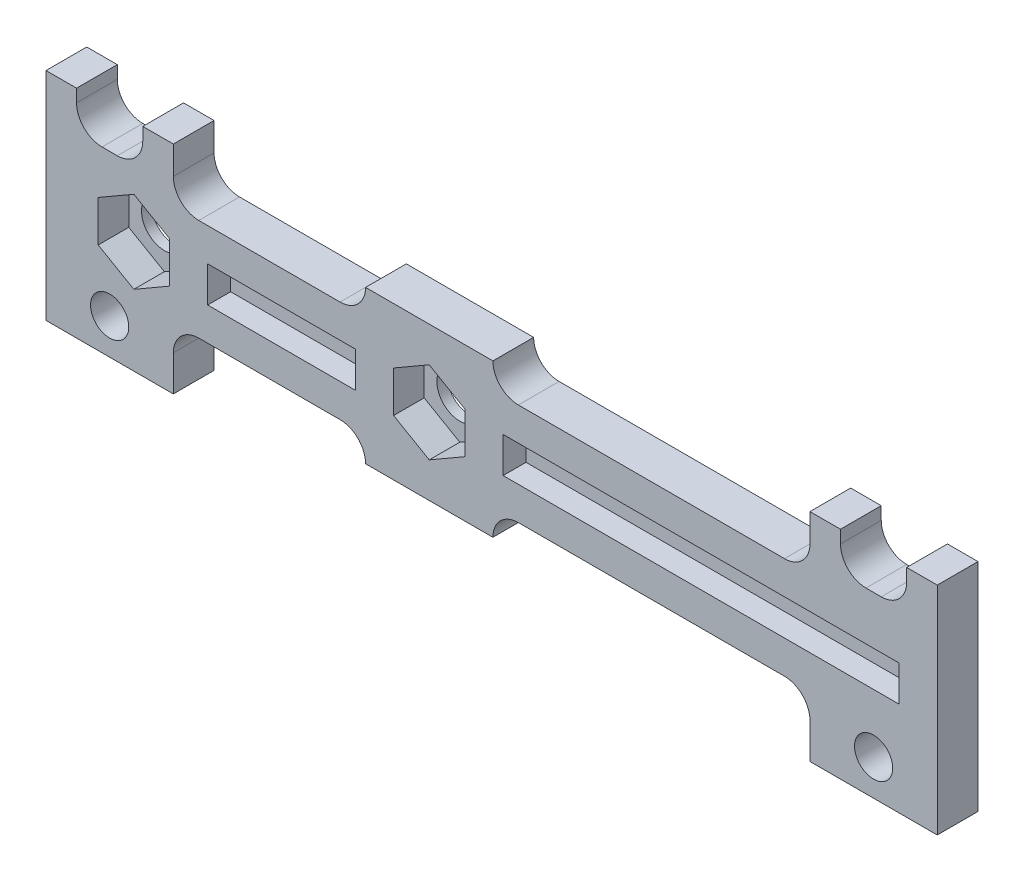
ISO-10303-21;
HEADER;
FILE_DESCRIPTION(('STEP AP214'),'2;1');
FILE_NAME('part.step','',(''),(''),'','','');
FILE_SCHEMA(('AUTOMOTIVE_DESIGN { 1 0 10303 214 1 1 1 1 }'));
ENDSEC;
DATA;
#1=APPLICATION_CONTEXT('core data for automotive mechanical design processes');
#2=APPLICATION_PROTOCOL_DEFINITION('international standard','automotive_design',2000,#1);
#3=PRODUCT_CONTEXT('',#1,'mechanical');
#4=PRODUCT('Part','Part','',(#3));
#5=PRODUCT_RELATED_PRODUCT_CATEGORY('part','',(#4));
#6=PRODUCT_DEFINITION_FORMATION('','',#4);
#7=PRODUCT_DEFINITION_CONTEXT('part definition',#1,'design');
#8=PRODUCT_DEFINITION('design','',#6,#7);
#9=PRODUCT_DEFINITION_SHAPE('','',#8);
#10=(LENGTH_UNIT() NAMED_UNIT(*) SI_UNIT(.MILLI.,.METRE.));
#11=(NAMED_UNIT(*) PLANE_ANGLE_UNIT() SI_UNIT($,.RADIAN.));
#12=(NAMED_UNIT(*) SI_UNIT($,.STERADIAN.) SOLID_ANGLE_UNIT());
#13=UNCERTAINTY_MEASURE_WITH_UNIT(LENGTH_MEASURE(1.E-05),#10,'distance_accuracy_value','');
#14=(GEOMETRIC_REPRESENTATION_CONTEXT(3) GLOBAL_UNCERTAINTY_ASSIGNED_CONTEXT((#13)) GLOBAL_UNIT_ASSIGNED_CONTEXT((#10,
#11,#12)) REPRESENTATION_CONTEXT('',''));
#15=CARTESIAN_POINT('',(0.,0.,0.));
#16=DIRECTION('',(0.,0.,1.));
#17=DIRECTION('',(1.,0.,0.));
#18=AXIS2_PLACEMENT_3D('',#15,#16,#17);
#19=CARTESIAN_POINT('',(0.,0.,0.));
#20=DIRECTION('',(0.,0.,1.));
#21=DIRECTION('',(1.,0.,0.));
#22=AXIS2_PLACEMENT_3D('',#19,#20,#21);
#23=PLANE('',#22);
#24=CARTESIAN_POINT('',(0.732758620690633,-9.73879310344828,0.));
#25=DIRECTION('',(0.,0.,-1.));
#26=DIRECTION('',(-1.,0.,0.));
#27=AXIS2_PLACEMENT_3D('',#24,#25,#26);
#28=CIRCLE('',#27,2.3);
#29=CARTESIAN_POINT('',(-1.56724137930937,-9.73879310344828,0.));
#30=VERTEX_POINT('',#29);
#31=EDGE_CURVE('E608',#30,#30,#28,.T.);
#32=ORIENTED_EDGE('',*,*,#31,.F.);
#33=EDGE_LOOP('',(#32));
#34=FACE_BOUND('',#33,.T.);
#35=CARTESIAN_POINT('',(60.7327586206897,-9.73879310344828,0.));
#36=DIRECTION('',(0.,0.,-1.));
#37=DIRECTION('',(-1.,0.,0.));
#38=AXIS2_PLACEMENT_3D('',#35,#36,#37);
#39=CIRCLE('',#38,2.3);
#40=CARTESIAN_POINT('',(58.4327586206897,-9.73879310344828,0.));
#41=VERTEX_POINT('',#40);
#42=EDGE_CURVE('E614',#41,#41,#39,.T.);
#43=ORIENTED_EDGE('',*,*,#42,.F.);
#44=EDGE_LOOP('',(#43));
#45=FACE_BOUND('',#44,.T.);
#46=CARTESIAN_POINT('',(25.8327586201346,-3.7387931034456,0.));
#47=DIRECTION('',(0.,0.,1.));
#48=DIRECTION('',(1.,0.,0.));
#49=AXIS2_PLACEMENT_3D('',#46,#47,#48);
#50=CIRCLE('',#49,1.80000000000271);
#51=CARTESIAN_POINT('',(27.6327586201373,-3.7387931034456,0.));
#52=VERTEX_POINT('',#51);
#53=EDGE_CURVE('E640',#52,#52,#50,.T.);
#54=ORIENTED_EDGE('',*,*,#53,.T.);
#55=EDGE_LOOP('',(#54));
#56=FACE_BOUND('',#55,.T.);
#57=CARTESIAN_POINT('',(2.6327586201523,-3.73879310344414,0.));
#58=DIRECTION('',(0.,0.,1.));
#59=DIRECTION('',(1.,0.,0.));
#60=AXIS2_PLACEMENT_3D('',#57,#58,#59);
#61=CIRCLE('',#60,1.8);
#62=CARTESIAN_POINT('',(4.4327586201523,-3.73879310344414,0.));
#63=VERTEX_POINT('',#62);
#64=EDGE_CURVE('E741',#63,#63,#61,.T.);
#65=ORIENTED_EDGE('',*,*,#64,.T.);
#66=EDGE_LOOP('',(#65));
#67=FACE_BOUND('',#66,.T.);
#68=DIRECTION('',(0.,-1.,0.));
#69=VECTOR('',#68,1.);
#70=CARTESIAN_POINT('',(58.1327586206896,4.46120689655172,0.));
#71=LINE('',#70,#69);
#72=CARTESIAN_POINT('',(58.1327586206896,4.46120689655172,0.));
#73=VERTEX_POINT('',#72);
#74=CARTESIAN_POINT('',(58.1327586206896,3.46120689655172,0.));
#75=VERTEX_POINT('',#74);
#76=EDGE_CURVE('E654',#73,#75,#71,.T.);
#77=ORIENTED_EDGE('',*,*,#76,.T.);
#78=CARTESIAN_POINT('',(60.1327586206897,3.46120689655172,0.));
#79=DIRECTION('',(0.,0.,1.));
#80=DIRECTION('',(1.,0.,0.));
#81=AXIS2_PLACEMENT_3D('',#78,#79,#80);
#82=CIRCLE('',#81,2.);
#83=CARTESIAN_POINT('',(60.1327586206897,1.46120689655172,0.));
#84=VERTEX_POINT('',#83);
#85=EDGE_CURVE('E856',#75,#84,#82,.T.);
#86=ORIENTED_EDGE('',*,*,#85,.T.);
#87=DIRECTION('',(1.,0.,0.));
#88=VECTOR('',#87,1.);
#89=CARTESIAN_POINT('',(58.1327586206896,1.46120689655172,0.));
#90=LINE('',#89,#88);
#91=CARTESIAN_POINT('',(61.3327586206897,1.46120689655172,0.));
#92=VERTEX_POINT('',#91);
#93=EDGE_CURVE('E651',#84,#92,#90,.T.);
#94=ORIENTED_EDGE('',*,*,#93,.T.);
#95=CARTESIAN_POINT('',(61.3327586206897,3.46120689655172,0.));
#96=DIRECTION('',(0.,0.,1.));
#97=DIRECTION('',(1.,0.,0.));
#98=AXIS2_PLACEMENT_3D('',#95,#96,#97);
#99=CIRCLE('',#98,2.);
#100=CARTESIAN_POINT('',(63.3327586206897,3.46120689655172,0.));
#101=VERTEX_POINT('',#100);
#102=EDGE_CURVE('E852',#92,#101,#99,.T.);
#103=ORIENTED_EDGE('',*,*,#102,.T.);
#104=DIRECTION('',(0.,1.,0.));
#105=VECTOR('',#104,1.);
#106=CARTESIAN_POINT('',(63.3327586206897,4.46120689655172,0.));
#107=LINE('',#106,#105);
#108=CARTESIAN_POINT('',(63.3327586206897,4.46120689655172,0.));
#109=VERTEX_POINT('',#108);
#110=EDGE_CURVE('E648',#101,#109,#107,.T.);
#111=ORIENTED_EDGE('',*,*,#110,.T.);
#112=DIRECTION('',(-1.,0.,0.));
#113=VECTOR('',#112,1.);
#114=CARTESIAN_POINT('',(55.7327586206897,4.46120689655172,0.));
#115=LINE('',#114,#113);
#116=CARTESIAN_POINT('',(65.7327586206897,4.46120689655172,0.));
#117=VERTEX_POINT('',#116);
#118=EDGE_CURVE('E711',#117,#109,#115,.T.);
#119=ORIENTED_EDGE('',*,*,#118,.F.);
#120=DIRECTION('',(0.,1.,0.));
#121=VECTOR('',#120,1.);
#122=CARTESIAN_POINT('',(65.7327586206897,0.261206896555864,0.));
#123=LINE('',#122,#121);
#124=CARTESIAN_POINT('',(65.7327586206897,-12.5387931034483,0.));
#125=VERTEX_POINT('',#124);
#126=EDGE_CURVE('E734',#125,#117,#123,.T.);
#127=ORIENTED_EDGE('',*,*,#126,.F.);
#128=DIRECTION('',(1.,0.,0.));
#129=VECTOR('',#128,1.);
#130=CARTESIAN_POINT('',(55.7327586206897,-12.5387931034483,0.));
#131=LINE('',#130,#129);
#132=CARTESIAN_POINT('',(55.7327586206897,-12.5387931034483,0.));
#133=VERTEX_POINT('',#132);
#134=EDGE_CURVE('E707',#133,#125,#131,.T.);
#135=ORIENTED_EDGE('',*,*,#134,.F.);
#136=DIRECTION('',(0.,-1.,0.));
#137=VECTOR('',#136,1.);
#138=CARTESIAN_POINT('',(55.7327586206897,-12.5387931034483,0.));
#139=LINE('',#138,#137);
#140=CARTESIAN_POINT('',(55.7327586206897,-9.73879310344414,0.));
#141=VERTEX_POINT('',#140);
#142=EDGE_CURVE('E703',#141,#133,#139,.T.);
#143=ORIENTED_EDGE('',*,*,#142,.F.);
#144=CARTESIAN_POINT('',(53.7327586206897,-9.73879310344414,0.));
#145=DIRECTION('',(0.,0.,1.));
#146=DIRECTION('',(1.,0.,0.));
#147=AXIS2_PLACEMENT_3D('',#144,#145,#146);
#148=CIRCLE('',#147,2.);
#149=CARTESIAN_POINT('',(53.7327586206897,-7.73879310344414,0.));
#150=VERTEX_POINT('',#149);
#151=EDGE_CURVE('E834',#141,#150,#148,.T.);
#152=ORIENTED_EDGE('',*,*,#151,.T.);
#153=DIRECTION('',(1.,0.,0.));
#154=VECTOR('',#153,1.);
#155=CARTESIAN_POINT('',(5.73275862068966,-7.73879310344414,0.));
#156=LINE('',#155,#154);
#157=CARTESIAN_POINT('',(32.8327586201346,-7.73879310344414,0.));
#158=VERTEX_POINT('',#157);
#159=EDGE_CURVE('E726',#158,#150,#156,.T.);
#160=ORIENTED_EDGE('',*,*,#159,.F.);
#161=CARTESIAN_POINT('',(32.8327586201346,-9.73879310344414,0.));
#162=DIRECTION('',(0.,0.,1.));
#163=DIRECTION('',(1.,0.,0.));
#164=AXIS2_PLACEMENT_3D('',#161,#162,#163);
#165=CIRCLE('',#164,2.);
#166=CARTESIAN_POINT('',(30.8327586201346,-9.73879310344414,0.));
#167=VERTEX_POINT('',#166);
#168=EDGE_CURVE('E882',#158,#167,#165,.T.);
#169=ORIENTED_EDGE('',*,*,#168,.T.);
#170=DIRECTION('',(1.,0.,0.));
#171=VECTOR('',#170,1.);
#172=CARTESIAN_POINT('',(30.8327586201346,-9.73879310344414,0.));
#173=LINE('',#172,#171);
#174=CARTESIAN_POINT('',(20.8327586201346,-9.73879310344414,0.));
#175=VERTEX_POINT('',#174);
#176=EDGE_CURVE('E621',#175,#167,#173,.T.);
#177=ORIENTED_EDGE('',*,*,#176,.F.);
#178=CARTESIAN_POINT('',(18.8327586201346,-9.73879310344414,0.));
#179=DIRECTION('',(0.,0.,1.));
#180=DIRECTION('',(1.,0.,0.));
#181=AXIS2_PLACEMENT_3D('',#178,#179,#180);
#182=CIRCLE('',#181,2.);
#183=CARTESIAN_POINT('',(18.8327586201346,-7.73879310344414,0.));
#184=VERTEX_POINT('',#183);
#185=EDGE_CURVE('E878',#175,#184,#182,.T.);
#186=ORIENTED_EDGE('',*,*,#185,.T.);
#187=CARTESIAN_POINT('',(7.73275862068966,-7.73879310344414,0.));
#188=VERTEX_POINT('',#187);
#189=EDGE_CURVE('E736',#188,#184,#156,.T.);
#190=ORIENTED_EDGE('',*,*,#189,.F.);
#191=CARTESIAN_POINT('',(7.73275862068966,-9.73879310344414,0.));
#192=DIRECTION('',(0.,0.,1.));
#193=DIRECTION('',(1.,0.,0.));
#194=AXIS2_PLACEMENT_3D('',#191,#192,#193);
#195=CIRCLE('',#194,2.);
#196=CARTESIAN_POINT('',(5.73275862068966,-9.73879310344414,0.));
#197=VERTEX_POINT('',#196);
#198=EDGE_CURVE('E839',#188,#197,#195,.T.);
#199=ORIENTED_EDGE('',*,*,#198,.T.);
#200=DIRECTION('',(0.,1.,0.));
#201=VECTOR('',#200,1.);
#202=CARTESIAN_POINT('',(5.73275862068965,4.46120689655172,0.));
#203=LINE('',#202,#201);
#204=CARTESIAN_POINT('',(5.73275862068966,-12.5387931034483,0.));
#205=VERTEX_POINT('',#204);
#206=EDGE_CURVE('E775',#205,#197,#203,.T.);
#207=ORIENTED_EDGE('',*,*,#206,.F.);
#208=DIRECTION('',(1.,0.,0.));
#209=VECTOR('',#208,1.);
#210=CARTESIAN_POINT('',(-4.26724137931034,-12.5387931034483,0.));
#211=LINE('',#210,#209);
#212=CARTESIAN_POINT('',(-4.26724137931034,-12.5387931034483,0.));
#213=VERTEX_POINT('',#212);
#214=EDGE_CURVE('E772',#213,#205,#211,.T.);
#215=ORIENTED_EDGE('',*,*,#214,.F.);
#216=DIRECTION('',(0.,-1.,0.));
#217=VECTOR('',#216,1.);
#218=CARTESIAN_POINT('',(-4.26724137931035,4.46120689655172,0.));
#219=LINE('',#218,#217);
#220=CARTESIAN_POINT('',(-4.26724137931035,4.46120689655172,0.));
#221=VERTEX_POINT('',#220);
#222=EDGE_CURVE('E754',#221,#213,#219,.T.);
#223=ORIENTED_EDGE('',*,*,#222,.F.);
#224=DIRECTION('',(-1.,0.,0.));
#225=VECTOR('',#224,1.);
#226=CARTESIAN_POINT('',(-4.26724137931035,4.46120689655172,0.));
#227=LINE('',#226,#225);
#228=CARTESIAN_POINT('',(-1.86724137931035,4.46120689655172,0.));
#229=VERTEX_POINT('',#228);
#230=EDGE_CURVE('E778',#229,#221,#227,.T.);
#231=ORIENTED_EDGE('',*,*,#230,.F.);
#232=DIRECTION('',(0.,-1.,0.));
#233=VECTOR('',#232,1.);
#234=CARTESIAN_POINT('',(-1.86724137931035,4.46120689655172,0.));
#235=LINE('',#234,#233);
#236=CARTESIAN_POINT('',(-1.86724137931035,3.46120689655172,0.));
#237=VERTEX_POINT('',#236);
#238=EDGE_CURVE('E674',#229,#237,#235,.T.);
#239=ORIENTED_EDGE('',*,*,#238,.T.);
#240=CARTESIAN_POINT('',(0.132758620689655,3.46120689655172,0.));
#241=DIRECTION('',(0.,0.,1.));
#242=DIRECTION('',(1.,0.,0.));
#243=AXIS2_PLACEMENT_3D('',#240,#241,#242);
#244=CIRCLE('',#243,2.);
#245=CARTESIAN_POINT('',(0.132758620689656,1.46120689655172,0.));
#246=VERTEX_POINT('',#245);
#247=EDGE_CURVE('E864',#237,#246,#244,.T.);
#248=ORIENTED_EDGE('',*,*,#247,.T.);
#249=DIRECTION('',(1.,0.,0.));
#250=VECTOR('',#249,1.);
#251=CARTESIAN_POINT('',(3.33275862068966,1.46120689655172,0.));
#252=LINE('',#251,#250);
#253=CARTESIAN_POINT('',(1.33275862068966,1.46120689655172,0.));
#254=VERTEX_POINT('',#253);
#255=EDGE_CURVE('E670',#246,#254,#252,.T.);
#256=ORIENTED_EDGE('',*,*,#255,.T.);
#257=CARTESIAN_POINT('',(1.33275862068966,3.46120689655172,0.));
#258=DIRECTION('',(0.,0.,1.));
#259=DIRECTION('',(1.,0.,0.));
#260=AXIS2_PLACEMENT_3D('',#257,#258,#259);
#261=CIRCLE('',#260,2.);
#262=CARTESIAN_POINT('',(3.33275862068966,3.46120689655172,0.));
#263=VERTEX_POINT('',#262);
#264=EDGE_CURVE('E860',#254,#263,#261,.T.);
#265=ORIENTED_EDGE('',*,*,#264,.T.);
#266=DIRECTION('',(0.,1.,0.));
#267=VECTOR('',#266,1.);
#268=CARTESIAN_POINT('',(3.33275862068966,4.46120689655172,0.));
#269=LINE('',#268,#267);
#270=CARTESIAN_POINT('',(3.33275862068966,4.46120689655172,0.));
#271=VERTEX_POINT('',#270);
#272=EDGE_CURVE('E659',#263,#271,#269,.T.);
#273=ORIENTED_EDGE('',*,*,#272,.T.);
#274=CARTESIAN_POINT('',(5.73275862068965,4.46120689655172,0.));
#275=VERTEX_POINT('',#274);
#276=EDGE_CURVE('E759',#275,#271,#227,.T.);
#277=ORIENTED_EDGE('',*,*,#276,.F.);
#278=CARTESIAN_POINT('',(5.73275862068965,2.26120689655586,0.));
#279=VERTEX_POINT('',#278);
#280=EDGE_CURVE('E774',#279,#275,#203,.T.);
#281=ORIENTED_EDGE('',*,*,#280,.F.);
#282=CARTESIAN_POINT('',(7.73275862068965,2.26120689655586,0.));
#283=DIRECTION('',(0.,0.,1.));
#284=DIRECTION('',(1.,0.,0.));
#285=AXIS2_PLACEMENT_3D('',#282,#283,#284);
#286=CIRCLE('',#285,2.);
#287=CARTESIAN_POINT('',(7.73275862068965,0.261206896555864,0.));
#288=VERTEX_POINT('',#287);
#289=EDGE_CURVE('E843',#279,#288,#286,.T.);
#290=ORIENTED_EDGE('',*,*,#289,.T.);
#291=DIRECTION('',(-1.,0.,0.));
#292=VECTOR('',#291,1.);
#293=CARTESIAN_POINT('',(5.73275862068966,0.261206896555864,0.));
#294=LINE('',#293,#292);
#295=CARTESIAN_POINT('',(18.8327586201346,0.261206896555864,0.));
#296=VERTEX_POINT('',#295);
#297=EDGE_CURVE('E733',#296,#288,#294,.T.);
#298=ORIENTED_EDGE('',*,*,#297,.F.);
#299=CARTESIAN_POINT('',(18.8327586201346,2.26120689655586,0.));
#300=DIRECTION('',(0.,0.,1.));
#301=DIRECTION('',(1.,0.,0.));
#302=AXIS2_PLACEMENT_3D('',#299,#300,#301);
#303=CIRCLE('',#302,2.);
#304=CARTESIAN_POINT('',(20.8327586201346,2.26120689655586,0.));
#305=VERTEX_POINT('',#304);
#306=EDGE_CURVE('E886',#296,#305,#303,.T.);
#307=ORIENTED_EDGE('',*,*,#306,.T.);
#308=DIRECTION('',(-1.,0.,0.));
#309=VECTOR('',#308,1.);
#310=CARTESIAN_POINT('',(30.8327586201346,2.26120689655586,0.));
#311=LINE('',#310,#309);
#312=CARTESIAN_POINT('',(30.8327586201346,2.26120689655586,0.));
#313=VERTEX_POINT('',#312);
#314=EDGE_CURVE('E633',#313,#305,#311,.T.);
#315=ORIENTED_EDGE('',*,*,#314,.F.);
#316=CARTESIAN_POINT('',(32.8327586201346,2.26120689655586,0.));
#317=DIRECTION('',(0.,0.,1.));
#318=DIRECTION('',(1.,0.,0.));
#319=AXIS2_PLACEMENT_3D('',#316,#317,#318);
#320=CIRCLE('',#319,2.);
#321=CARTESIAN_POINT('',(32.8327586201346,0.261206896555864,0.));
#322=VERTEX_POINT('',#321);
#323=EDGE_CURVE('E41',#313,#322,#320,.T.);
#324=ORIENTED_EDGE('',*,*,#323,.T.);
#325=CARTESIAN_POINT('',(53.7327586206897,0.261206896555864,0.));
#326=VERTEX_POINT('',#325);
#327=EDGE_CURVE('E729',#326,#322,#294,.T.);
#328=ORIENTED_EDGE('',*,*,#327,.F.);
#329=CARTESIAN_POINT('',(53.7327586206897,2.26120689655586,0.));
#330=DIRECTION('',(0.,0.,1.));
#331=DIRECTION('',(1.,0.,0.));
#332=AXIS2_PLACEMENT_3D('',#329,#330,#331);
#333=CIRCLE('',#332,2.);
#334=CARTESIAN_POINT('',(55.7327586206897,2.26120689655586,0.));
#335=VERTEX_POINT('',#334);
#336=EDGE_CURVE('E850',#326,#335,#333,.T.);
#337=ORIENTED_EDGE('',*,*,#336,.T.);
#338=CARTESIAN_POINT('',(55.7327586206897,4.46120689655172,0.));
#339=VERTEX_POINT('',#338);
#340=EDGE_CURVE('E704',#339,#335,#139,.T.);
#341=ORIENTED_EDGE('',*,*,#340,.F.);
#342=EDGE_CURVE('E710',#73,#339,#115,.T.);
#343=ORIENTED_EDGE('',*,*,#342,.F.);
#344=EDGE_LOOP('',(#77,#86,#94,#103,#111,#119,#127,#135,#143,#152,#160,#169,#177,#186,#190,#199,
#207,#215,#223,#231,#239,#248,#256,#265,#273,#277,#281,#290,#298,#307,#315,#324,#328,#337,#341,#343));
#345=FACE_BOUND('',#344,.T.);
#346=DIRECTION('',(0.,1.,0.));
#347=VECTOR('',#346,1.);
#348=CARTESIAN_POINT('',(61.1221816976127,-5.73879310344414,0.));
#349=LINE('',#348,#347);
#350=CARTESIAN_POINT('',(61.1221816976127,-5.73879310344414,0.));
#351=VERTEX_POINT('',#350);
#352=CARTESIAN_POINT('',(61.1221816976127,-0.44712643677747,0.));
#353=VERTEX_POINT('',#352);
#354=EDGE_CURVE('E49',#351,#353,#349,.T.);
#355=ORIENTED_EDGE('',*,*,#354,.T.);
#356=DIRECTION('',(-1.,0.,0.));
#357=VECTOR('',#356,1.);
#358=CARTESIAN_POINT('',(61.1221816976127,-0.44712643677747,0.));
#359=LINE('',#358,#357);
#360=CARTESIAN_POINT('',(60.1723953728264,-0.44712643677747,0.));
#361=VERTEX_POINT('',#360);
#362=EDGE_CURVE('E442',#353,#361,#359,.T.);
#363=ORIENTED_EDGE('',*,*,#362,.T.);
#364=DIRECTION('',(0.,-1.,0.));
#365=VECTOR('',#364,1.);
#366=CARTESIAN_POINT('',(60.1723953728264,-0.44712643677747,0.));
#367=LINE('',#366,#365);
#368=CARTESIAN_POINT('',(60.1723953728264,-4.78900677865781,0.));
#369=VERTEX_POINT('',#368);
#370=EDGE_CURVE('E1556',#361,#369,#367,.T.);
#371=ORIENTED_EDGE('',*,*,#370,.T.);
#372=DIRECTION('',(-1.,0.,0.));
#373=VECTOR('',#372,1.);
#374=CARTESIAN_POINT('',(60.1723953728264,-4.78900677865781,0.));
#375=LINE('',#374,#373);
#376=CARTESIAN_POINT('',(58.679874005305,-4.78900677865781,0.));
#377=VERTEX_POINT('',#376);
#378=EDGE_CURVE('E1553',#369,#377,#375,.T.);
#379=ORIENTED_EDGE('',*,*,#378,.T.);
#380=DIRECTION('',(0.,-1.,0.));
#381=VECTOR('',#380,1.);
#382=CARTESIAN_POINT('',(58.679874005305,-4.78900677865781,0.));
#383=LINE('',#382,#381);
#384=CARTESIAN_POINT('',(58.679874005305,-5.73879310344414,0.));
#385=VERTEX_POINT('',#384);
#386=EDGE_CURVE('E1547',#377,#385,#383,.T.);
#387=ORIENTED_EDGE('',*,*,#386,.T.);
#388=DIRECTION('',(1.,0.,0.));
#389=VECTOR('',#388,1.);
#390=CARTESIAN_POINT('',(58.679874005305,-5.73879310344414,0.));
#391=LINE('',#390,#389);
#392=EDGE_CURVE('E438',#385,#351,#391,.T.);
#393=ORIENTED_EDGE('',*,*,#392,.T.);
#394=EDGE_LOOP('',(#355,#363,#371,#379,#387,#393));
#395=FACE_BOUND('',#394,.T.);
#396=ADVANCED_FACE('F32',(#34,#45,#56,#67,#345,#395),#23,.F.);
#397=CARTESIAN_POINT('',(25.8327586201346,-3.7387931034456,8.2911688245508));
#398=DIRECTION('',(0.,0.,-1.));
#399=DIRECTION('',(-1.,0.,0.));
#400=AXIS2_PLACEMENT_3D('',#397,#398,#399);
#401=CYLINDRICAL_SURFACE('',#400,1.80000000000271);
#402=ORIENTED_EDGE('',*,*,#53,.F.);
#403=EDGE_LOOP('',(#402));
#404=FACE_BOUND('',#403,.T.);
#405=CARTESIAN_POINT('',(25.8327586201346,-3.7387931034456,0.8));
#406=DIRECTION('',(0.,0.,1.));
#407=DIRECTION('',(1.,0.,0.));
#408=AXIS2_PLACEMENT_3D('',#405,#406,#407);
#409=CIRCLE('',#408,1.80000000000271);
#410=CARTESIAN_POINT('',(27.6327586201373,-3.7387931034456,0.8));
#411=VERTEX_POINT('',#410);
#412=EDGE_CURVE('E36',#411,#411,#409,.T.);
#413=ORIENTED_EDGE('',*,*,#412,.T.);
#414=EDGE_LOOP('',(#413));
#415=FACE_BOUND('',#414,.T.);
#416=ADVANCED_FACE('F1101',(#404,#415),#401,.F.);
#417=CARTESIAN_POINT('',(2.6327586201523,-3.73879310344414,8.29116882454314));
#418=DIRECTION('',(0.,0.,-1.));
#419=DIRECTION('',(-1.,0.,0.));
#420=AXIS2_PLACEMENT_3D('',#417,#418,#419);
#421=CYLINDRICAL_SURFACE('',#420,1.8);
#422=ORIENTED_EDGE('',*,*,#64,.F.);
#423=EDGE_LOOP('',(#422));
#424=FACE_BOUND('',#423,.T.);
#425=CARTESIAN_POINT('',(2.6327586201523,-3.73879310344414,0.8));
#426=DIRECTION('',(0.,0.,1.));
#427=DIRECTION('',(1.,0.,0.));
#428=AXIS2_PLACEMENT_3D('',#425,#426,#427);
#429=CIRCLE('',#428,1.8);
#430=CARTESIAN_POINT('',(4.4327586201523,-3.73879310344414,0.8));
#431=VERTEX_POINT('',#430);
#432=EDGE_CURVE('E597',#431,#431,#429,.T.);
#433=ORIENTED_EDGE('',*,*,#432,.T.);
#434=EDGE_LOOP('',(#433));
#435=FACE_BOUND('',#434,.T.);
#436=ADVANCED_FACE('F893',(#424,#435),#421,.F.);
#437=CARTESIAN_POINT('',(0.732758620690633,-9.73879310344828,5.4));
#438=DIRECTION('',(0.,0.,-1.));
#439=DIRECTION('',(-1.,0.,0.));
#440=AXIS2_PLACEMENT_3D('',#437,#438,#439);
#441=CYLINDRICAL_SURFACE('',#440,1.5);
#442=CARTESIAN_POINT('',(0.732758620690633,-9.73879310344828,3.2));
#443=DIRECTION('',(0.,0.,1.));
#444=DIRECTION('',(1.,0.,0.));
#445=AXIS2_PLACEMENT_3D('',#442,#443,#444);
#446=CIRCLE('',#445,1.5);
#447=CARTESIAN_POINT('',(2.23275862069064,-9.73879310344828,3.2));
#448=VERTEX_POINT('',#447);
#449=EDGE_CURVE('E751',#448,#448,#446,.F.);
#450=ORIENTED_EDGE('',*,*,#449,.F.);
#451=EDGE_LOOP('',(#450));
#452=FACE_BOUND('',#451,.T.);
#453=CARTESIAN_POINT('',(0.732758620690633,-9.73879310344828,0.8));
#454=DIRECTION('',(0.,0.,-1.));
#455=DIRECTION('',(-1.,0.,0.));
#456=AXIS2_PLACEMENT_3D('',#453,#454,#455);
#457=CIRCLE('',#456,1.5);
#458=CARTESIAN_POINT('',(-0.767241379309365,-9.73879310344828,0.8));
#459=VERTEX_POINT('',#458);
#460=EDGE_CURVE('E611',#459,#459,#457,.T.);
#461=ORIENTED_EDGE('',*,*,#460,.T.);
#462=EDGE_LOOP('',(#461));
#463=FACE_BOUND('',#462,.T.);
#464=ADVANCED_FACE('F1194',(#452,#463),#441,.F.);
#465=CARTESIAN_POINT('',(5.73275862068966,-7.73879310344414,63.7309838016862));
#466=DIRECTION('',(0.,1.,0.));
#467=DIRECTION('',(0.,0.,1.));
#468=AXIS2_PLACEMENT_3D('',#465,#466,#467);
#469=PLANE('',#468);
#470=DIRECTION('',(1.,0.,0.));
#471=VECTOR('',#470,1.);
#472=CARTESIAN_POINT('',(5.73275862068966,-7.73879310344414,3.2));
#473=LINE('',#472,#471);
#474=CARTESIAN_POINT('',(32.8327586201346,-7.73879310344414,3.2));
#475=VERTEX_POINT('',#474);
#476=CARTESIAN_POINT('',(53.7327586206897,-7.73879310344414,3.2));
#477=VERTEX_POINT('',#476);
#478=EDGE_CURVE('E745',#475,#477,#473,.T.);
#479=ORIENTED_EDGE('',*,*,#478,.F.);
#480=DIRECTION('',(0.,0.,-1.));
#481=VECTOR('',#480,1.);
#482=CARTESIAN_POINT('',(32.8327586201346,-7.73879310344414,0.));
#483=LINE('',#482,#481);
#484=EDGE_CURVE('E870',#475,#158,#483,.T.);
#485=ORIENTED_EDGE('',*,*,#484,.T.);
#486=ORIENTED_EDGE('',*,*,#159,.T.);
#487=DIRECTION('',(0.,0.,-1.));
#488=VECTOR('',#487,1.);
#489=CARTESIAN_POINT('',(53.7327586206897,-7.73879310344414,3.2));
#490=LINE('',#489,#488);
#491=EDGE_CURVE('E798',#150,#477,#490,.F.);
#492=ORIENTED_EDGE('',*,*,#491,.T.);
#493=EDGE_LOOP('',(#479,#485,#486,#492));
#494=FACE_BOUND('',#493,.T.);
#495=ADVANCED_FACE('F1060',(#494),#469,.F.);
#496=ORIENTED_EDGE('',*,*,#189,.T.);
#497=DIRECTION('',(0.,0.,-1.));
#498=VECTOR('',#497,1.);
#499=CARTESIAN_POINT('',(18.8327586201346,-7.73879310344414,3.2));
#500=LINE('',#499,#498);
#501=CARTESIAN_POINT('',(18.8327586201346,-7.73879310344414,3.2));
#502=VERTEX_POINT('',#501);
#503=EDGE_CURVE('E868',#184,#502,#500,.F.);
#504=ORIENTED_EDGE('',*,*,#503,.T.);
#505=CARTESIAN_POINT('',(7.73275862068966,-7.73879310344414,3.2));
#506=VERTEX_POINT('',#505);
#507=EDGE_CURVE('E742',#506,#502,#473,.T.);
#508=ORIENTED_EDGE('',*,*,#507,.F.);
#509=DIRECTION('',(0.,0.,-1.));
#510=VECTOR('',#509,1.);
#511=CARTESIAN_POINT('',(7.73275862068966,-7.73879310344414,0.));
#512=LINE('',#511,#510);
#513=EDGE_CURVE('E795',#506,#188,#512,.T.);
#514=ORIENTED_EDGE('',*,*,#513,.T.);
#515=EDGE_LOOP('',(#496,#504,#508,#514));
#516=FACE_BOUND('',#515,.T.);
#517=ADVANCED_FACE('F1044',(#516),#469,.F.);
#518=CARTESIAN_POINT('',(5.73275862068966,0.261206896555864,63.7309838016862));
#519=DIRECTION('',(0.,-1.,0.));
#520=DIRECTION('',(0.,0.,-1.));
#521=AXIS2_PLACEMENT_3D('',#518,#519,#520);
#522=PLANE('',#521);
#523=ORIENTED_EDGE('',*,*,#327,.T.);
#524=DIRECTION('',(0.,0.,-1.));
#525=VECTOR('',#524,1.);
#526=CARTESIAN_POINT('',(32.8327586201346,0.261206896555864,3.2));
#527=LINE('',#526,#525);
#528=CARTESIAN_POINT('',(32.8327586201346,0.261206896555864,3.2));
#529=VERTEX_POINT('',#528);
#530=EDGE_CURVE('E876',#322,#529,#527,.F.);
#531=ORIENTED_EDGE('',*,*,#530,.T.);
#532=DIRECTION('',(-1.,0.,0.));
#533=VECTOR('',#532,1.);
#534=CARTESIAN_POINT('',(5.73275862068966,0.261206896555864,3.2));
#535=LINE('',#534,#533);
#536=CARTESIAN_POINT('',(53.7327586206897,0.261206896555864,3.2));
#537=VERTEX_POINT('',#536);
#538=EDGE_CURVE('E746',#537,#529,#535,.T.);
#539=ORIENTED_EDGE('',*,*,#538,.F.);
#540=DIRECTION('',(0.,0.,1.));
#541=VECTOR('',#540,1.);
#542=CARTESIAN_POINT('',(53.7327586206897,0.261206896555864,0.));
#543=LINE('',#542,#541);
#544=EDGE_CURVE('E806',#537,#326,#543,.F.);
#545=ORIENTED_EDGE('',*,*,#544,.T.);
#546=EDGE_LOOP('',(#523,#531,#539,#545));
#547=FACE_BOUND('',#546,.T.);
#548=ADVANCED_FACE('F966',(#547),#522,.F.);
#549=CARTESIAN_POINT('',(18.8327586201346,0.261206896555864,3.2));
#550=VERTEX_POINT('',#549);
#551=CARTESIAN_POINT('',(7.73275862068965,0.261206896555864,3.2));
#552=VERTEX_POINT('',#551);
#553=EDGE_CURVE('E732',#550,#552,#535,.T.);
#554=ORIENTED_EDGE('',*,*,#553,.F.);
#555=DIRECTION('',(0.,0.,-1.));
#556=VECTOR('',#555,1.);
#557=CARTESIAN_POINT('',(18.8327586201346,0.261206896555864,0.));
#558=LINE('',#557,#556);
#559=EDGE_CURVE('E873',#550,#296,#558,.T.);
#560=ORIENTED_EDGE('',*,*,#559,.T.);
#561=ORIENTED_EDGE('',*,*,#297,.T.);
#562=DIRECTION('',(0.,0.,-1.));
#563=VECTOR('',#562,1.);
#564=CARTESIAN_POINT('',(7.73275862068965,0.261206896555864,3.2));
#565=LINE('',#564,#563);
#566=EDGE_CURVE('E808',#288,#552,#565,.F.);
#567=ORIENTED_EDGE('',*,*,#566,.T.);
#568=EDGE_LOOP('',(#554,#560,#561,#567));
#569=FACE_BOUND('',#568,.T.);
#570=ADVANCED_FACE('F929',(#569),#522,.F.);
#571=CARTESIAN_POINT('',(0.,0.,3.2));
#572=DIRECTION('',(0.,0.,1.));
#573=DIRECTION('',(1.,0.,0.));
#574=AXIS2_PLACEMENT_3D('',#571,#572,#573);
#575=PLANE('',#574);
#576=DIRECTION('',(0.,-1.,0.));
#577=VECTOR('',#576,1.);
#578=CARTESIAN_POINT('',(31.6327586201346,-2.33879310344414,3.2));
#579=LINE('',#578,#577);
#580=CARTESIAN_POINT('',(31.6327586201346,-2.33879310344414,3.2));
#581=VERTEX_POINT('',#580);
#582=CARTESIAN_POINT('',(31.6327586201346,-5.13879310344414,3.2));
#583=VERTEX_POINT('',#582);
#584=EDGE_CURVE('E57',#581,#583,#579,.T.);
#585=ORIENTED_EDGE('',*,*,#584,.F.);
#586=DIRECTION('',(-1.,0.,0.));
#587=VECTOR('',#586,1.);
#588=CARTESIAN_POINT('',(31.6327586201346,-2.33879310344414,3.2));
#589=LINE('',#588,#587);
#590=CARTESIAN_POINT('',(62.7327586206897,-2.33879310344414,3.2));
#591=VERTEX_POINT('',#590);
#592=EDGE_CURVE('E455',#591,#581,#589,.T.);
#593=ORIENTED_EDGE('',*,*,#592,.F.);
#594=DIRECTION('',(0.,1.,0.));
#595=VECTOR('',#594,1.);
#596=CARTESIAN_POINT('',(62.7327586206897,-2.33879310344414,3.2));
#597=LINE('',#596,#595);
#598=CARTESIAN_POINT('',(62.7327586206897,-5.13879310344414,3.2));
#599=VERTEX_POINT('',#598);
#600=EDGE_CURVE('E467',#599,#591,#597,.T.);
#601=ORIENTED_EDGE('',*,*,#600,.F.);
#602=DIRECTION('',(1.,0.,0.));
#603=VECTOR('',#602,1.);
#604=CARTESIAN_POINT('',(31.6327586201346,-5.13879310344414,3.2));
#605=LINE('',#604,#603);
#606=EDGE_CURVE('E445',#583,#599,#605,.T.);
#607=ORIENTED_EDGE('',*,*,#606,.F.);
#608=EDGE_LOOP('',(#585,#593,#601,#607));
#609=FACE_BOUND('',#608,.T.);
#610=DIRECTION('',(0.,-1.,0.));
#611=VECTOR('',#610,1.);
#612=CARTESIAN_POINT('',(8.4327586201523,-2.33879310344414,3.2));
#613=LINE('',#612,#611);
#614=CARTESIAN_POINT('',(8.4327586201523,-2.33879310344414,3.2));
#615=VERTEX_POINT('',#614);
#616=CARTESIAN_POINT('',(8.4327586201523,-5.13879310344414,3.2));
#617=VERTEX_POINT('',#616);
#618=EDGE_CURVE('E474',#615,#617,#613,.T.);
#619=ORIENTED_EDGE('',*,*,#618,.F.);
#620=DIRECTION('',(-1.,0.,0.));
#621=VECTOR('',#620,1.);
#622=CARTESIAN_POINT('',(8.4327586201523,-2.33879310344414,3.2));
#623=LINE('',#622,#621);
#624=CARTESIAN_POINT('',(20.0327586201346,-2.33879310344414,3.2));
#625=VERTEX_POINT('',#624);
#626=EDGE_CURVE('E484',#625,#615,#623,.T.);
#627=ORIENTED_EDGE('',*,*,#626,.F.);
#628=DIRECTION('',(0.,1.,0.));
#629=VECTOR('',#628,1.);
#630=CARTESIAN_POINT('',(20.0327586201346,-2.33879310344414,3.2));
#631=LINE('',#630,#629);
#632=CARTESIAN_POINT('',(20.0327586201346,-5.13879310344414,3.2));
#633=VERTEX_POINT('',#632);
#634=EDGE_CURVE('E498',#633,#625,#631,.T.);
#635=ORIENTED_EDGE('',*,*,#634,.F.);
#636=DIRECTION('',(1.,0.,0.));
#637=VECTOR('',#636,1.);
#638=CARTESIAN_POINT('',(8.4327586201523,-5.13879310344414,3.2));
#639=LINE('',#638,#637);
#640=EDGE_CURVE('E495',#617,#633,#639,.T.);
#641=ORIENTED_EDGE('',*,*,#640,.F.);
#642=EDGE_LOOP('',(#619,#627,#635,#641));
#643=FACE_BOUND('',#642,.T.);
#644=DIRECTION('',(0.866025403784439,-0.5,0.));
#645=VECTOR('',#644,1.);
#646=CARTESIAN_POINT('',(23.0327586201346,-5.35537385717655,3.2));
#647=LINE('',#646,#645);
#648=CARTESIAN_POINT('',(23.0327586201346,-5.35537385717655,3.2));
#649=VERTEX_POINT('',#648);
#650=CARTESIAN_POINT('',(25.8327586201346,-6.97195461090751,3.2));
#651=VERTEX_POINT('',#650);
#652=EDGE_CURVE('E505',#649,#651,#647,.T.);
#653=ORIENTED_EDGE('',*,*,#652,.F.);
#654=DIRECTION('',(0.,-1.,0.));
#655=VECTOR('',#654,1.);
#656=CARTESIAN_POINT('',(23.0327586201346,-2.12221234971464,3.2));
#657=LINE('',#656,#655);
#658=CARTESIAN_POINT('',(23.0327586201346,-2.12221234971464,3.2));
#659=VERTEX_POINT('',#658);
#660=EDGE_CURVE('E516',#659,#649,#657,.T.);
#661=ORIENTED_EDGE('',*,*,#660,.F.);
#662=DIRECTION('',(-0.866025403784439,-0.5,0.));
#663=VECTOR('',#662,1.);
#664=CARTESIAN_POINT('',(25.8327586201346,-0.505631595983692,3.2));
#665=LINE('',#664,#663);
#666=CARTESIAN_POINT('',(25.8327586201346,-0.505631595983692,3.2));
#667=VERTEX_POINT('',#666);
#668=EDGE_CURVE('E542',#667,#659,#665,.T.);
#669=ORIENTED_EDGE('',*,*,#668,.F.);
#670=DIRECTION('',(-0.866025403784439,0.5,0.));
#671=VECTOR('',#670,1.);
#672=CARTESIAN_POINT('',(28.6327586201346,-2.12221234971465,3.2));
#673=LINE('',#672,#671);
#674=CARTESIAN_POINT('',(28.6327586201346,-2.12221234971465,3.2));
#675=VERTEX_POINT('',#674);
#676=EDGE_CURVE('E539',#675,#667,#673,.T.);
#677=ORIENTED_EDGE('',*,*,#676,.F.);
#678=DIRECTION('',(0.,1.,0.));
#679=VECTOR('',#678,1.);
#680=CARTESIAN_POINT('',(28.6327586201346,-5.35537385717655,3.2));
#681=LINE('',#680,#679);
#682=CARTESIAN_POINT('',(28.6327586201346,-5.35537385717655,3.2));
#683=VERTEX_POINT('',#682);
#684=EDGE_CURVE('E536',#683,#675,#681,.T.);
#685=ORIENTED_EDGE('',*,*,#684,.F.);
#686=DIRECTION('',(0.866025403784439,0.5,0.));
#687=VECTOR('',#686,1.);
#688=CARTESIAN_POINT('',(25.8327586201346,-6.9719546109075,3.2));
#689=LINE('',#688,#687);
#690=EDGE_CURVE('E533',#651,#683,#689,.T.);
#691=ORIENTED_EDGE('',*,*,#690,.F.);
#692=EDGE_LOOP('',(#653,#661,#669,#677,#685,#691));
#693=FACE_BOUND('',#692,.T.);
#694=DIRECTION('',(0.866025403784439,-0.5,0.));
#695=VECTOR('',#694,1.);
#696=CARTESIAN_POINT('',(-0.1672413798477,-5.35537385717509,3.2));
#697=LINE('',#696,#695);
#698=CARTESIAN_POINT('',(-0.1672413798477,-5.35537385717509,3.2));
#699=VERTEX_POINT('',#698);
#700=CARTESIAN_POINT('',(2.6327586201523,-6.97195461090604,3.2));
#701=VERTEX_POINT('',#700);
#702=EDGE_CURVE('E579',#699,#701,#697,.T.);
#703=ORIENTED_EDGE('',*,*,#702,.F.);
#704=DIRECTION('',(0.,-1.,0.));
#705=VECTOR('',#704,1.);
#706=CARTESIAN_POINT('',(-0.1672413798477,-2.12221234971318,3.2));
#707=LINE('',#706,#705);
#708=CARTESIAN_POINT('',(-0.1672413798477,-2.12221234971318,3.2));
#709=VERTEX_POINT('',#708);
#710=EDGE_CURVE('E563',#709,#699,#707,.T.);
#711=ORIENTED_EDGE('',*,*,#710,.F.);
#712=DIRECTION('',(-0.866025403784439,-0.5,0.));
#713=VECTOR('',#712,1.);
#714=CARTESIAN_POINT('',(2.6327586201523,-0.505631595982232,3.2));
#715=LINE('',#714,#713);
#716=CARTESIAN_POINT('',(2.6327586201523,-0.505631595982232,3.2));
#717=VERTEX_POINT('',#716);
#718=EDGE_CURVE('E590',#717,#709,#715,.T.);
#719=ORIENTED_EDGE('',*,*,#718,.F.);
#720=DIRECTION('',(-0.866025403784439,0.5,0.));
#721=VECTOR('',#720,1.);
#722=CARTESIAN_POINT('',(5.4327586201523,-2.12221234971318,3.2));
#723=LINE('',#722,#721);
#724=CARTESIAN_POINT('',(5.4327586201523,-2.12221234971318,3.2));
#725=VERTEX_POINT('',#724);
#726=EDGE_CURVE('E587',#725,#717,#723,.T.);
#727=ORIENTED_EDGE('',*,*,#726,.F.);
#728=DIRECTION('',(0.,1.,0.));
#729=VECTOR('',#728,1.);
#730=CARTESIAN_POINT('',(5.4327586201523,-5.35537385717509,3.2));
#731=LINE('',#730,#729);
#732=CARTESIAN_POINT('',(5.4327586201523,-5.35537385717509,3.2));
#733=VERTEX_POINT('',#732);
#734=EDGE_CURVE('E584',#733,#725,#731,.T.);
#735=ORIENTED_EDGE('',*,*,#734,.F.);
#736=DIRECTION('',(0.866025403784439,0.5,0.));
#737=VECTOR('',#736,1.);
#738=CARTESIAN_POINT('',(2.6327586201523,-6.97195461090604,3.2));
#739=LINE('',#738,#737);
#740=EDGE_CURVE('E581',#701,#733,#739,.T.);
#741=ORIENTED_EDGE('',*,*,#740,.F.);
#742=EDGE_LOOP('',(#703,#711,#719,#727,#735,#741));
#743=FACE_BOUND('',#742,.T.);
#744=CARTESIAN_POINT('',(60.7327586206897,-9.73879310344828,3.2));
#745=DIRECTION('',(0.,0.,1.));
#746=DIRECTION('',(1.,0.,0.));
#747=AXIS2_PLACEMENT_3D('',#744,#745,#746);
#748=CIRCLE('',#747,1.49999999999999);
#749=CARTESIAN_POINT('',(62.2327586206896,-9.73879310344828,3.2));
#750=VERTEX_POINT('',#749);
#751=EDGE_CURVE('E683',#750,#750,#748,.T.);
#752=ORIENTED_EDGE('',*,*,#751,.F.);
#753=EDGE_LOOP('',(#752));
#754=FACE_BOUND('',#753,.T.);
#755=ORIENTED_EDGE('',*,*,#449,.T.);
#756=EDGE_LOOP('',(#755));
#757=FACE_BOUND('',#756,.T.);
#758=DIRECTION('',(1.,0.,0.));
#759=VECTOR('',#758,1.);
#760=CARTESIAN_POINT('',(58.1327586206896,1.46120689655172,3.2));
#761=LINE('',#760,#759);
#762=CARTESIAN_POINT('',(60.1327586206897,1.46120689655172,3.2));
#763=VERTEX_POINT('',#762);
#764=CARTESIAN_POINT('',(61.3327586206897,1.46120689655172,3.2));
#765=VERTEX_POINT('',#764);
#766=EDGE_CURVE('E660',#763,#765,#761,.T.);
#767=ORIENTED_EDGE('',*,*,#766,.F.);
#768=CARTESIAN_POINT('',(60.1327586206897,3.46120689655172,3.2));
#769=DIRECTION('',(0.,0.,1.));
#770=DIRECTION('',(1.,0.,0.));
#771=AXIS2_PLACEMENT_3D('',#768,#769,#770);
#772=CIRCLE('',#771,2.);
#773=CARTESIAN_POINT('',(58.1327586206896,3.46120689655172,3.2));
#774=VERTEX_POINT('',#773);
#775=EDGE_CURVE('E858',#763,#774,#772,.F.);
#776=ORIENTED_EDGE('',*,*,#775,.T.);
#777=DIRECTION('',(0.,-1.,0.));
#778=VECTOR('',#777,1.);
#779=CARTESIAN_POINT('',(58.1327586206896,4.46120689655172,3.2));
#780=LINE('',#779,#778);
#781=CARTESIAN_POINT('',(58.1327586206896,4.46120689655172,3.2));
#782=VERTEX_POINT('',#781);
#783=EDGE_CURVE('E663',#782,#774,#780,.T.);
#784=ORIENTED_EDGE('',*,*,#783,.F.);
#785=DIRECTION('',(-1.,0.,0.));
#786=VECTOR('',#785,1.);
#787=CARTESIAN_POINT('',(55.7327586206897,4.46120689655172,3.2));
#788=LINE('',#787,#786);
#789=CARTESIAN_POINT('',(55.7327586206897,4.46120689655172,3.2));
#790=VERTEX_POINT('',#789);
#791=EDGE_CURVE('E696',#782,#790,#788,.T.);
#792=ORIENTED_EDGE('',*,*,#791,.T.);
#793=DIRECTION('',(0.,-1.,0.));
#794=VECTOR('',#793,1.);
#795=CARTESIAN_POINT('',(55.7327586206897,-12.5387931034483,3.2));
#796=LINE('',#795,#794);
#797=CARTESIAN_POINT('',(55.7327586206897,2.26120689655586,3.2));
#798=VERTEX_POINT('',#797);
#799=EDGE_CURVE('E700',#790,#798,#796,.T.);
#800=ORIENTED_EDGE('',*,*,#799,.T.);
#801=CARTESIAN_POINT('',(53.7327586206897,2.26120689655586,3.2));
#802=DIRECTION('',(0.,0.,1.));
#803=DIRECTION('',(1.,0.,0.));
#804=AXIS2_PLACEMENT_3D('',#801,#802,#803);
#805=CIRCLE('',#804,2.);
#806=EDGE_CURVE('E848',#798,#537,#805,.F.);
#807=ORIENTED_EDGE('',*,*,#806,.T.);
#808=ORIENTED_EDGE('',*,*,#538,.T.);
#809=CARTESIAN_POINT('',(32.8327586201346,2.26120689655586,3.2));
#810=DIRECTION('',(0.,0.,1.));
#811=DIRECTION('',(1.,0.,0.));
#812=AXIS2_PLACEMENT_3D('',#809,#810,#811);
#813=CIRCLE('',#812,2.);
#814=CARTESIAN_POINT('',(30.8327586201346,2.26120689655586,3.2));
#815=VERTEX_POINT('',#814);
#816=EDGE_CURVE('E11',#529,#815,#813,.F.);
#817=ORIENTED_EDGE('',*,*,#816,.T.);
#818=DIRECTION('',(-1.,0.,0.));
#819=VECTOR('',#818,1.);
#820=CARTESIAN_POINT('',(30.8327586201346,2.26120689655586,3.2));
#821=LINE('',#820,#819);
#822=CARTESIAN_POINT('',(20.8327586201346,2.26120689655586,3.2));
#823=VERTEX_POINT('',#822);
#824=EDGE_CURVE('E637',#815,#823,#821,.T.);
#825=ORIENTED_EDGE('',*,*,#824,.T.);
#826=CARTESIAN_POINT('',(18.8327586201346,2.26120689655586,3.2));
#827=DIRECTION('',(0.,0.,1.));
#828=DIRECTION('',(1.,0.,0.));
#829=AXIS2_PLACEMENT_3D('',#826,#827,#828);
#830=CIRCLE('',#829,2.);
#831=EDGE_CURVE('E888',#823,#550,#830,.F.);
#832=ORIENTED_EDGE('',*,*,#831,.T.);
#833=ORIENTED_EDGE('',*,*,#553,.T.);
#834=CARTESIAN_POINT('',(7.73275862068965,2.26120689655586,3.2));
#835=DIRECTION('',(0.,0.,1.));
#836=DIRECTION('',(1.,0.,0.));
#837=AXIS2_PLACEMENT_3D('',#834,#835,#836);
#838=CIRCLE('',#837,2.);
#839=CARTESIAN_POINT('',(5.73275862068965,2.26120689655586,3.2));
#840=VERTEX_POINT('',#839);
#841=EDGE_CURVE('E846',#552,#840,#838,.F.);
#842=ORIENTED_EDGE('',*,*,#841,.T.);
#843=DIRECTION('',(0.,1.,0.));
#844=VECTOR('',#843,1.);
#845=CARTESIAN_POINT('',(5.73275862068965,4.46120689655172,3.2));
#846=LINE('',#845,#844);
#847=CARTESIAN_POINT('',(5.73275862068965,4.46120689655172,3.2));
#848=VERTEX_POINT('',#847);
#849=EDGE_CURVE('E761',#840,#848,#846,.T.);
#850=ORIENTED_EDGE('',*,*,#849,.T.);
#851=DIRECTION('',(-1.,0.,0.));
#852=VECTOR('',#851,1.);
#853=CARTESIAN_POINT('',(-4.26724137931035,4.46120689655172,3.2));
#854=LINE('',#853,#852);
#855=CARTESIAN_POINT('',(3.33275862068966,4.46120689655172,3.2));
#856=VERTEX_POINT('',#855);
#857=EDGE_CURVE('E766',#848,#856,#854,.T.);
#858=ORIENTED_EDGE('',*,*,#857,.T.);
#859=DIRECTION('',(0.,1.,0.));
#860=VECTOR('',#859,1.);
#861=CARTESIAN_POINT('',(3.33275862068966,4.46120689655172,3.2));
#862=LINE('',#861,#860);
#863=CARTESIAN_POINT('',(3.33275862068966,3.46120689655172,3.2));
#864=VERTEX_POINT('',#863);
#865=EDGE_CURVE('E684',#864,#856,#862,.T.);
#866=ORIENTED_EDGE('',*,*,#865,.F.);
#867=CARTESIAN_POINT('',(1.33275862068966,3.46120689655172,3.2));
#868=DIRECTION('',(0.,0.,1.));
#869=DIRECTION('',(1.,0.,0.));
#870=AXIS2_PLACEMENT_3D('',#867,#868,#869);
#871=CIRCLE('',#870,2.);
#872=CARTESIAN_POINT('',(1.33275862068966,1.46120689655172,3.2));
#873=VERTEX_POINT('',#872);
#874=EDGE_CURVE('E862',#864,#873,#871,.F.);
#875=ORIENTED_EDGE('',*,*,#874,.T.);
#876=DIRECTION('',(1.,0.,0.));
#877=VECTOR('',#876,1.);
#878=CARTESIAN_POINT('',(3.33275862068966,1.46120689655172,3.2));
#879=LINE('',#878,#877);
#880=CARTESIAN_POINT('',(0.132758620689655,1.46120689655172,3.2));
#881=VERTEX_POINT('',#880);
#882=EDGE_CURVE('E673',#881,#873,#879,.T.);
#883=ORIENTED_EDGE('',*,*,#882,.F.);
#884=CARTESIAN_POINT('',(0.132758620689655,3.46120689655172,3.2));
#885=DIRECTION('',(0.,0.,1.));
#886=DIRECTION('',(1.,0.,0.));
#887=AXIS2_PLACEMENT_3D('',#884,#885,#886);
#888=CIRCLE('',#887,2.);
#889=CARTESIAN_POINT('',(-1.86724137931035,3.46120689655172,3.2));
#890=VERTEX_POINT('',#889);
#891=EDGE_CURVE('E866',#881,#890,#888,.F.);
#892=ORIENTED_EDGE('',*,*,#891,.T.);
#893=DIRECTION('',(0.,-1.,0.));
#894=VECTOR('',#893,1.);
#895=CARTESIAN_POINT('',(-1.86724137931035,4.46120689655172,3.2));
#896=LINE('',#895,#894);
#897=CARTESIAN_POINT('',(-1.86724137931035,4.46120689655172,3.2));
#898=VERTEX_POINT('',#897);
#899=EDGE_CURVE('E680',#898,#890,#896,.T.);
#900=ORIENTED_EDGE('',*,*,#899,.F.);
#901=CARTESIAN_POINT('',(-4.26724137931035,4.46120689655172,3.2));
#902=VERTEX_POINT('',#901);
#903=EDGE_CURVE('E765',#898,#902,#854,.T.);
#904=ORIENTED_EDGE('',*,*,#903,.T.);
#905=DIRECTION('',(0.,-1.,0.));
#906=VECTOR('',#905,1.);
#907=CARTESIAN_POINT('',(-4.26724137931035,4.46120689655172,3.2));
#908=LINE('',#907,#906);
#909=CARTESIAN_POINT('',(-4.26724137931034,-12.5387931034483,3.2));
#910=VERTEX_POINT('',#909);
#911=EDGE_CURVE('E755',#902,#910,#908,.T.);
#912=ORIENTED_EDGE('',*,*,#911,.T.);
#913=DIRECTION('',(1.,0.,0.));
#914=VECTOR('',#913,1.);
#915=CARTESIAN_POINT('',(-4.26724137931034,-12.5387931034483,3.2));
#916=LINE('',#915,#914);
#917=CARTESIAN_POINT('',(5.73275862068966,-12.5387931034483,3.2));
#918=VERTEX_POINT('',#917);
#919=EDGE_CURVE('E758',#910,#918,#916,.T.);
#920=ORIENTED_EDGE('',*,*,#919,.T.);
#921=CARTESIAN_POINT('',(5.73275862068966,-9.73879310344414,3.2));
#922=VERTEX_POINT('',#921);
#923=EDGE_CURVE('E762',#918,#922,#846,.T.);
#924=ORIENTED_EDGE('',*,*,#923,.T.);
#925=CARTESIAN_POINT('',(7.73275862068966,-9.73879310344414,3.2));
#926=DIRECTION('',(0.,0.,1.));
#927=DIRECTION('',(1.,0.,0.));
#928=AXIS2_PLACEMENT_3D('',#925,#926,#927);
#929=CIRCLE('',#928,2.);
#930=EDGE_CURVE('E841',#922,#506,#929,.F.);
#931=ORIENTED_EDGE('',*,*,#930,.T.);
#932=ORIENTED_EDGE('',*,*,#507,.T.);
#933=CARTESIAN_POINT('',(18.8327586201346,-9.73879310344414,3.2));
#934=DIRECTION('',(0.,0.,1.));
#935=DIRECTION('',(1.,0.,0.));
#936=AXIS2_PLACEMENT_3D('',#933,#934,#935);
#937=CIRCLE('',#936,2.);
#938=CARTESIAN_POINT('',(20.8327586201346,-9.73879310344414,3.2));
#939=VERTEX_POINT('',#938);
#940=EDGE_CURVE('E880',#502,#939,#937,.F.);
#941=ORIENTED_EDGE('',*,*,#940,.T.);
#942=DIRECTION('',(1.,0.,0.));
#943=VECTOR('',#942,1.);
#944=CARTESIAN_POINT('',(30.8327586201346,-9.73879310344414,3.2));
#945=LINE('',#944,#943);
#946=CARTESIAN_POINT('',(30.8327586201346,-9.73879310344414,3.2));
#947=VERTEX_POINT('',#946);
#948=EDGE_CURVE('E624',#939,#947,#945,.T.);
#949=ORIENTED_EDGE('',*,*,#948,.T.);
#950=CARTESIAN_POINT('',(32.8327586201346,-9.73879310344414,3.2));
#951=DIRECTION('',(0.,0.,1.));
#952=DIRECTION('',(1.,0.,0.));
#953=AXIS2_PLACEMENT_3D('',#950,#951,#952);
#954=CIRCLE('',#953,2.);
#955=EDGE_CURVE('E884',#947,#475,#954,.F.);
#956=ORIENTED_EDGE('',*,*,#955,.T.);
#957=ORIENTED_EDGE('',*,*,#478,.T.);
#958=CARTESIAN_POINT('',(53.7327586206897,-9.73879310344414,3.2));
#959=DIRECTION('',(0.,0.,1.));
#960=DIRECTION('',(1.,0.,0.));
#961=AXIS2_PLACEMENT_3D('',#958,#959,#960);
#962=CIRCLE('',#961,2.);
#963=CARTESIAN_POINT('',(55.7327586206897,-9.73879310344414,3.2));
#964=VERTEX_POINT('',#963);
#965=EDGE_CURVE('E837',#477,#964,#962,.F.);
#966=ORIENTED_EDGE('',*,*,#965,.T.);
#967=CARTESIAN_POINT('',(55.7327586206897,-12.5387931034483,3.2));
#968=VERTEX_POINT('',#967);
#969=EDGE_CURVE('E699',#964,#968,#796,.T.);
#970=ORIENTED_EDGE('',*,*,#969,.T.);
#971=DIRECTION('',(1.,0.,0.));
#972=VECTOR('',#971,1.);
#973=CARTESIAN_POINT('',(55.7327586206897,-12.5387931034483,3.2));
#974=LINE('',#973,#972);
#975=CARTESIAN_POINT('',(65.7327586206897,-12.5387931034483,3.2));
#976=VERTEX_POINT('',#975);
#977=EDGE_CURVE('E695',#968,#976,#974,.T.);
#978=ORIENTED_EDGE('',*,*,#977,.T.);
#979=DIRECTION('',(0.,1.,0.));
#980=VECTOR('',#979,1.);
#981=CARTESIAN_POINT('',(65.7327586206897,0.261206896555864,3.2));
#982=LINE('',#981,#980);
#983=CARTESIAN_POINT('',(65.7327586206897,4.46120689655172,3.2));
#984=VERTEX_POINT('',#983);
#985=EDGE_CURVE('E739',#976,#984,#982,.T.);
#986=ORIENTED_EDGE('',*,*,#985,.T.);
#987=CARTESIAN_POINT('',(63.3327586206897,4.46120689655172,3.2));
#988=VERTEX_POINT('',#987);
#989=EDGE_CURVE('E692',#984,#988,#788,.T.);
#990=ORIENTED_EDGE('',*,*,#989,.T.);
#991=DIRECTION('',(0.,1.,0.));
#992=VECTOR('',#991,1.);
#993=CARTESIAN_POINT('',(63.3327586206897,4.46120689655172,3.2));
#994=LINE('',#993,#992);
#995=CARTESIAN_POINT('',(63.3327586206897,3.46120689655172,3.2));
#996=VERTEX_POINT('',#995);
#997=EDGE_CURVE('E657',#996,#988,#994,.T.);
#998=ORIENTED_EDGE('',*,*,#997,.F.);
#999=CARTESIAN_POINT('',(61.3327586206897,3.46120689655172,3.2));
#1000=DIRECTION('',(0.,0.,1.));
#1001=DIRECTION('',(1.,0.,0.));
#1002=AXIS2_PLACEMENT_3D('',#999,#1000,#1001);
#1003=CIRCLE('',#1002,2.);
#1004=EDGE_CURVE('E854',#996,#765,#1003,.F.);
#1005=ORIENTED_EDGE('',*,*,#1004,.T.);
#1006=EDGE_LOOP('',(#767,#776,#784,#792,#800,#807,#808,#817,#825,#832,#833,#842,#850,#858,#866,
#875,#883,#892,#900,#904,#912,#920,#924,#931,#932,#941,#949,#956,#957,#966,#970,#978,#986,#990,
#998,#1005));
#1007=FACE_BOUND('',#1006,.T.);
#1008=ADVANCED_FACE('F925',(#609,#643,#693,#743,#754,#757,#1007),#575,.T.);
#1009=CARTESIAN_POINT('',(55.7327586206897,4.46120689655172,22.923082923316));
#1010=DIRECTION('',(0.,-1.,0.));
#1011=DIRECTION('',(0.,0.,-1.));
#1012=AXIS2_PLACEMENT_3D('',#1009,#1010,#1011);
#1013=PLANE('',#1012);
#1014=DIRECTION('',(0.,0.,-1.));
#1015=VECTOR('',#1014,1.);
#1016=CARTESIAN_POINT('',(58.1327586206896,4.46120689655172,9.20333240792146));
#1017=LINE('',#1016,#1015);
#1018=EDGE_CURVE('E647',#782,#73,#1017,.T.);
#1019=ORIENTED_EDGE('',*,*,#1018,.T.);
#1020=ORIENTED_EDGE('',*,*,#342,.T.);
#1021=DIRECTION('',(0.,0.,-1.));
#1022=VECTOR('',#1021,1.);
#1023=CARTESIAN_POINT('',(55.7327586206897,4.46120689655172,22.923082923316));
#1024=LINE('',#1023,#1022);
#1025=EDGE_CURVE('E714',#790,#339,#1024,.T.);
#1026=ORIENTED_EDGE('',*,*,#1025,.F.);
#1027=ORIENTED_EDGE('',*,*,#791,.F.);
#1028=EDGE_LOOP('',(#1019,#1020,#1026,#1027));
#1029=FACE_BOUND('',#1028,.T.);
#1030=ADVANCED_FACE('F928',(#1029),#1013,.F.);
#1031=DIRECTION('',(0.,0.,-1.));
#1032=VECTOR('',#1031,1.);
#1033=CARTESIAN_POINT('',(63.3327586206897,4.46120689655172,9.20333240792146));
#1034=LINE('',#1033,#1032);
#1035=EDGE_CURVE('E650',#988,#109,#1034,.T.);
#1036=ORIENTED_EDGE('',*,*,#1035,.F.);
#1037=ORIENTED_EDGE('',*,*,#989,.F.);
#1038=DIRECTION('',(0.,0.,-1.));
#1039=VECTOR('',#1038,1.);
#1040=CARTESIAN_POINT('',(65.7327586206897,4.46120689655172,22.923082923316));
#1041=LINE('',#1040,#1039);
#1042=EDGE_CURVE('E717',#984,#117,#1041,.T.);
#1043=ORIENTED_EDGE('',*,*,#1042,.T.);
#1044=ORIENTED_EDGE('',*,*,#118,.T.);
#1045=EDGE_LOOP('',(#1036,#1037,#1043,#1044));
#1046=FACE_BOUND('',#1045,.T.);
#1047=ADVANCED_FACE('F1084',(#1046),#1013,.F.);
#1048=CARTESIAN_POINT('',(-4.26724137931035,4.46120689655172,3.2));
#1049=DIRECTION('',(0.,-1.,0.));
#1050=DIRECTION('',(0.,0.,-1.));
#1051=AXIS2_PLACEMENT_3D('',#1048,#1049,#1050);
#1052=PLANE('',#1051);
#1053=DIRECTION('',(0.,0.,-1.));
#1054=VECTOR('',#1053,1.);
#1055=CARTESIAN_POINT('',(3.33275862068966,4.46120689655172,9.20333240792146));
#1056=LINE('',#1055,#1054);
#1057=EDGE_CURVE('E679',#856,#271,#1056,.T.);
#1058=ORIENTED_EDGE('',*,*,#1057,.F.);
#1059=ORIENTED_EDGE('',*,*,#857,.F.);
#1060=DIRECTION('',(0.,0.,-1.));
#1061=VECTOR('',#1060,1.);
#1062=CARTESIAN_POINT('',(5.73275862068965,4.46120689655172,3.2));
#1063=LINE('',#1062,#1061);
#1064=EDGE_CURVE('E783',#848,#275,#1063,.T.);
#1065=ORIENTED_EDGE('',*,*,#1064,.T.);
#1066=ORIENTED_EDGE('',*,*,#276,.T.);
#1067=EDGE_LOOP('',(#1058,#1059,#1065,#1066));
#1068=FACE_BOUND('',#1067,.T.);
#1069=ADVANCED_FACE('F998',(#1068),#1052,.F.);
#1070=DIRECTION('',(0.,0.,-1.));
#1071=VECTOR('',#1070,1.);
#1072=CARTESIAN_POINT('',(-1.86724137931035,4.46120689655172,9.20333240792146));
#1073=LINE('',#1072,#1071);
#1074=EDGE_CURVE('E677',#898,#229,#1073,.T.);
#1075=ORIENTED_EDGE('',*,*,#1074,.T.);
#1076=ORIENTED_EDGE('',*,*,#230,.T.);
#1077=DIRECTION('',(0.,0.,-1.));
#1078=VECTOR('',#1077,1.);
#1079=CARTESIAN_POINT('',(-4.26724137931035,4.46120689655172,3.2));
#1080=LINE('',#1079,#1078);
#1081=EDGE_CURVE('E769',#902,#221,#1080,.T.);
#1082=ORIENTED_EDGE('',*,*,#1081,.F.);
#1083=ORIENTED_EDGE('',*,*,#903,.F.);
#1084=EDGE_LOOP('',(#1075,#1076,#1082,#1083));
#1085=FACE_BOUND('',#1084,.T.);
#1086=ADVANCED_FACE('F1023',(#1085),#1052,.F.);
#1087=CARTESIAN_POINT('',(5.73275862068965,4.46120689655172,3.2));
#1088=DIRECTION('',(-1.,0.,0.));
#1089=DIRECTION('',(0.,-1.,0.));
#1090=AXIS2_PLACEMENT_3D('',#1087,#1088,#1089);
#1091=PLANE('',#1090);
#1092=ORIENTED_EDGE('',*,*,#206,.T.);
#1093=DIRECTION('',(0.,0.,-1.));
#1094=VECTOR('',#1093,1.);
#1095=CARTESIAN_POINT('',(5.73275862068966,-9.73879310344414,3.2));
#1096=LINE('',#1095,#1094);
#1097=EDGE_CURVE('E801',#197,#922,#1096,.F.);
#1098=ORIENTED_EDGE('',*,*,#1097,.T.);
#1099=ORIENTED_EDGE('',*,*,#923,.F.);
#1100=DIRECTION('',(0.,0.,-1.));
#1101=VECTOR('',#1100,1.);
#1102=CARTESIAN_POINT('',(5.73275862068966,-12.5387931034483,3.2));
#1103=LINE('',#1102,#1101);
#1104=EDGE_CURVE('E786',#918,#205,#1103,.T.);
#1105=ORIENTED_EDGE('',*,*,#1104,.T.);
#1106=EDGE_LOOP('',(#1092,#1098,#1099,#1105));
#1107=FACE_BOUND('',#1106,.T.);
#1108=ADVANCED_FACE('F1036',(#1107),#1091,.F.);
#1109=CARTESIAN_POINT('',(-4.26724137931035,4.46120689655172,3.2));
#1110=DIRECTION('',(1.,0.,0.));
#1111=DIRECTION('',(0.,1.,0.));
#1112=AXIS2_PLACEMENT_3D('',#1109,#1110,#1111);
#1113=PLANE('',#1112);
#1114=ORIENTED_EDGE('',*,*,#222,.T.);
#1115=DIRECTION('',(0.,0.,-1.));
#1116=VECTOR('',#1115,1.);
#1117=CARTESIAN_POINT('',(-4.26724137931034,-12.5387931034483,3.2));
#1118=LINE('',#1117,#1116);
#1119=EDGE_CURVE('E789',#910,#213,#1118,.T.);
#1120=ORIENTED_EDGE('',*,*,#1119,.F.);
#1121=ORIENTED_EDGE('',*,*,#911,.F.);
#1122=ORIENTED_EDGE('',*,*,#1081,.T.);
#1123=EDGE_LOOP('',(#1114,#1120,#1121,#1122));
#1124=FACE_BOUND('',#1123,.T.);
#1125=ADVANCED_FACE('F1028',(#1124),#1113,.F.);
#1126=CARTESIAN_POINT('',(-4.26724137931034,-12.5387931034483,3.2));
#1127=DIRECTION('',(0.,1.,0.));
#1128=DIRECTION('',(0.,0.,1.));
#1129=AXIS2_PLACEMENT_3D('',#1126,#1127,#1128);
#1130=PLANE('',#1129);
#1131=ORIENTED_EDGE('',*,*,#214,.T.);
#1132=ORIENTED_EDGE('',*,*,#1104,.F.);
#1133=ORIENTED_EDGE('',*,*,#919,.F.);
#1134=ORIENTED_EDGE('',*,*,#1119,.T.);
#1135=EDGE_LOOP('',(#1131,#1132,#1133,#1134));
#1136=FACE_BOUND('',#1135,.T.);
#1137=ADVANCED_FACE('F1033',(#1136),#1130,.F.);
#1138=ORIENTED_EDGE('',*,*,#849,.F.);
#1139=DIRECTION('',(0.,0.,-1.));
#1140=VECTOR('',#1139,1.);
#1141=CARTESIAN_POINT('',(5.73275862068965,2.26120689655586,0.));
#1142=LINE('',#1141,#1140);
#1143=EDGE_CURVE('E803',#840,#279,#1142,.T.);
#1144=ORIENTED_EDGE('',*,*,#1143,.T.);
#1145=ORIENTED_EDGE('',*,*,#280,.T.);
#1146=ORIENTED_EDGE('',*,*,#1064,.F.);
#1147=EDGE_LOOP('',(#1138,#1144,#1145,#1146));
#1148=FACE_BOUND('',#1147,.T.);
#1149=ADVANCED_FACE('F992',(#1148),#1091,.F.);
#1150=CARTESIAN_POINT('',(65.7327586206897,0.261206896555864,63.7309838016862));
#1151=DIRECTION('',(-1.,0.,0.));
#1152=DIRECTION('',(0.,0.,1.));
#1153=AXIS2_PLACEMENT_3D('',#1150,#1151,#1152);
#1154=PLANE('',#1153);
#1155=ORIENTED_EDGE('',*,*,#985,.F.);
#1156=DIRECTION('',(0.,0.,-1.));
#1157=VECTOR('',#1156,1.);
#1158=CARTESIAN_POINT('',(65.7327586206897,-12.5387931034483,22.923082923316));
#1159=LINE('',#1158,#1157);
#1160=EDGE_CURVE('E720',#976,#125,#1159,.T.);
#1161=ORIENTED_EDGE('',*,*,#1160,.T.);
#1162=ORIENTED_EDGE('',*,*,#126,.T.);
#1163=ORIENTED_EDGE('',*,*,#1042,.F.);
#1164=EDGE_LOOP('',(#1155,#1161,#1162,#1163));
#1165=FACE_BOUND('',#1164,.T.);
#1166=ADVANCED_FACE('F1080',(#1165),#1154,.F.);
#1167=CARTESIAN_POINT('',(55.7327586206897,-12.5387931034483,22.923082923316));
#1168=DIRECTION('',(1.,0.,0.));
#1169=DIRECTION('',(0.,0.,-1.));
#1170=AXIS2_PLACEMENT_3D('',#1167,#1168,#1169);
#1171=PLANE('',#1170);
#1172=ORIENTED_EDGE('',*,*,#340,.T.);
#1173=DIRECTION('',(0.,0.,1.));
#1174=VECTOR('',#1173,1.);
#1175=CARTESIAN_POINT('',(55.7327586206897,2.26120689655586,3.2));
#1176=LINE('',#1175,#1174);
#1177=EDGE_CURVE('E811',#335,#798,#1176,.T.);
#1178=ORIENTED_EDGE('',*,*,#1177,.T.);
#1179=ORIENTED_EDGE('',*,*,#799,.F.);
#1180=ORIENTED_EDGE('',*,*,#1025,.T.);
#1181=EDGE_LOOP('',(#1172,#1178,#1179,#1180));
#1182=FACE_BOUND('',#1181,.T.);
#1183=ADVANCED_FACE('F959',(#1182),#1171,.F.);
#1184=ORIENTED_EDGE('',*,*,#969,.F.);
#1185=DIRECTION('',(0.,0.,-1.));
#1186=VECTOR('',#1185,1.);
#1187=CARTESIAN_POINT('',(55.7327586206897,-9.73879310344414,0.));
#1188=LINE('',#1187,#1186);
#1189=EDGE_CURVE('E792',#964,#141,#1188,.T.);
#1190=ORIENTED_EDGE('',*,*,#1189,.T.);
#1191=ORIENTED_EDGE('',*,*,#142,.T.);
#1192=DIRECTION('',(0.,0.,-1.));
#1193=VECTOR('',#1192,1.);
#1194=CARTESIAN_POINT('',(55.7327586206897,-12.5387931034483,22.923082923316));
#1195=LINE('',#1194,#1193);
#1196=EDGE_CURVE('E723',#968,#133,#1195,.T.);
#1197=ORIENTED_EDGE('',*,*,#1196,.F.);
#1198=EDGE_LOOP('',(#1184,#1190,#1191,#1197));
#1199=FACE_BOUND('',#1198,.T.);
#1200=ADVANCED_FACE('F1071',(#1199),#1171,.F.);
#1201=CARTESIAN_POINT('',(55.7327586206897,-12.5387931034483,22.923082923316));
#1202=DIRECTION('',(0.,1.,0.));
#1203=DIRECTION('',(0.,0.,1.));
#1204=AXIS2_PLACEMENT_3D('',#1201,#1202,#1203);
#1205=PLANE('',#1204);
#1206=ORIENTED_EDGE('',*,*,#977,.F.);
#1207=ORIENTED_EDGE('',*,*,#1196,.T.);
#1208=ORIENTED_EDGE('',*,*,#134,.T.);
#1209=ORIENTED_EDGE('',*,*,#1160,.F.);
#1210=EDGE_LOOP('',(#1206,#1207,#1208,#1209));
#1211=FACE_BOUND('',#1210,.T.);
#1212=ADVANCED_FACE('F1075',(#1211),#1205,.F.);
#1213=CARTESIAN_POINT('',(60.7327586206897,-9.73879310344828,22.923082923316));
#1214=DIRECTION('',(0.,0.,-1.));
#1215=DIRECTION('',(-1.,0.,0.));
#1216=AXIS2_PLACEMENT_3D('',#1213,#1214,#1215);
#1217=CYLINDRICAL_SURFACE('',#1216,1.49999999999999);
#1218=CARTESIAN_POINT('',(60.7327586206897,-9.73879310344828,0.8));
#1219=DIRECTION('',(0.,0.,-1.));
#1220=DIRECTION('',(-1.,0.,0.));
#1221=AXIS2_PLACEMENT_3D('',#1218,#1219,#1220);
#1222=CIRCLE('',#1221,1.5);
#1223=CARTESIAN_POINT('',(59.2327586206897,-9.73879310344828,0.8));
#1224=VERTEX_POINT('',#1223);
#1225=EDGE_CURVE('E617',#1224,#1224,#1222,.T.);
#1226=ORIENTED_EDGE('',*,*,#1225,.T.);
#1227=EDGE_LOOP('',(#1226));
#1228=FACE_BOUND('',#1227,.T.);
#1229=ORIENTED_EDGE('',*,*,#751,.T.);
#1230=EDGE_LOOP('',(#1229));
#1231=FACE_BOUND('',#1230,.T.);
#1232=ADVANCED_FACE('F1205',(#1228,#1231),#1217,.F.);
#1233=CARTESIAN_POINT('',(3.33275862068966,4.46120689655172,9.20333240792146));
#1234=DIRECTION('',(-1.,0.,0.));
#1235=DIRECTION('',(0.,-1.,0.));
#1236=AXIS2_PLACEMENT_3D('',#1233,#1234,#1235);
#1237=PLANE('',#1236);
#1238=ORIENTED_EDGE('',*,*,#272,.F.);
#1239=DIRECTION('',(0.,0.,-1.));
#1240=VECTOR('',#1239,1.);
#1241=CARTESIAN_POINT('',(3.33275862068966,3.46120689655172,3.2));
#1242=LINE('',#1241,#1240);
#1243=EDGE_CURVE('E829',#263,#864,#1242,.F.);
#1244=ORIENTED_EDGE('',*,*,#1243,.T.);
#1245=ORIENTED_EDGE('',*,*,#865,.T.);
#1246=ORIENTED_EDGE('',*,*,#1057,.T.);
#1247=EDGE_LOOP('',(#1238,#1244,#1245,#1246));
#1248=FACE_BOUND('',#1247,.T.);
#1249=ADVANCED_FACE('F1209',(#1248),#1237,.T.);
#1250=CARTESIAN_POINT('',(-1.86724137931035,4.46120689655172,9.20333240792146));
#1251=DIRECTION('',(1.,0.,0.));
#1252=DIRECTION('',(0.,1.,0.));
#1253=AXIS2_PLACEMENT_3D('',#1250,#1251,#1252);
#1254=PLANE('',#1253);
#1255=ORIENTED_EDGE('',*,*,#899,.T.);
#1256=DIRECTION('',(0.,0.,-1.));
#1257=VECTOR('',#1256,1.);
#1258=CARTESIAN_POINT('',(-1.86724137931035,3.46120689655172,0.));
#1259=LINE('',#1258,#1257);
#1260=EDGE_CURVE('E831',#890,#237,#1259,.T.);
#1261=ORIENTED_EDGE('',*,*,#1260,.T.);
#1262=ORIENTED_EDGE('',*,*,#238,.F.);
#1263=ORIENTED_EDGE('',*,*,#1074,.F.);
#1264=EDGE_LOOP('',(#1255,#1261,#1262,#1263));
#1265=FACE_BOUND('',#1264,.T.);
#1266=ADVANCED_FACE('F1018',(#1265),#1254,.T.);
#1267=CARTESIAN_POINT('',(3.33275862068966,1.46120689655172,9.20333240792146));
#1268=DIRECTION('',(0.,1.,0.));
#1269=DIRECTION('',(-1.,0.,0.));
#1270=AXIS2_PLACEMENT_3D('',#1267,#1268,#1269);
#1271=PLANE('',#1270);
#1272=ORIENTED_EDGE('',*,*,#882,.T.);
#1273=DIRECTION('',(0.,0.,-1.));
#1274=VECTOR('',#1273,1.);
#1275=CARTESIAN_POINT('',(1.33275862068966,1.46120689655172,0.));
#1276=LINE('',#1275,#1274);
#1277=EDGE_CURVE('E826',#873,#254,#1276,.T.);
#1278=ORIENTED_EDGE('',*,*,#1277,.T.);
#1279=ORIENTED_EDGE('',*,*,#255,.F.);
#1280=DIRECTION('',(0.,0.,-1.));
#1281=VECTOR('',#1280,1.);
#1282=CARTESIAN_POINT('',(0.132758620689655,1.46120689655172,3.2));
#1283=LINE('',#1282,#1281);
#1284=EDGE_CURVE('E824',#246,#881,#1283,.F.);
#1285=ORIENTED_EDGE('',*,*,#1284,.T.);
#1286=EDGE_LOOP('',(#1272,#1278,#1279,#1285));
#1287=FACE_BOUND('',#1286,.T.);
#1288=ADVANCED_FACE('F1009',(#1287),#1271,.T.);
#1289=CARTESIAN_POINT('',(58.1327586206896,4.46120689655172,9.20333240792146));
#1290=DIRECTION('',(1.,0.,0.));
#1291=DIRECTION('',(0.,0.,-1.));
#1292=AXIS2_PLACEMENT_3D('',#1289,#1290,#1291);
#1293=PLANE('',#1292);
#1294=ORIENTED_EDGE('',*,*,#783,.T.);
#1295=DIRECTION('',(0.,0.,-1.));
#1296=VECTOR('',#1295,1.);
#1297=CARTESIAN_POINT('',(58.1327586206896,3.46120689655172,0.));
#1298=LINE('',#1297,#1296);
#1299=EDGE_CURVE('E821',#774,#75,#1298,.T.);
#1300=ORIENTED_EDGE('',*,*,#1299,.T.);
#1301=ORIENTED_EDGE('',*,*,#76,.F.);
#1302=ORIENTED_EDGE('',*,*,#1018,.F.);
#1303=EDGE_LOOP('',(#1294,#1300,#1301,#1302));
#1304=FACE_BOUND('',#1303,.T.);
#1305=ADVANCED_FACE('F948',(#1304),#1293,.T.);
#1306=CARTESIAN_POINT('',(58.1327586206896,1.46120689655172,9.20333240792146));
#1307=DIRECTION('',(0.,1.,0.));
#1308=DIRECTION('',(0.,0.,1.));
#1309=AXIS2_PLACEMENT_3D('',#1306,#1307,#1308);
#1310=PLANE('',#1309);
#1311=ORIENTED_EDGE('',*,*,#766,.T.);
#1312=DIRECTION('',(0.,0.,-1.));
#1313=VECTOR('',#1312,1.);
#1314=CARTESIAN_POINT('',(61.3327586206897,1.46120689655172,0.));
#1315=LINE('',#1314,#1313);
#1316=EDGE_CURVE('E816',#765,#92,#1315,.T.);
#1317=ORIENTED_EDGE('',*,*,#1316,.T.);
#1318=ORIENTED_EDGE('',*,*,#93,.F.);
#1319=DIRECTION('',(0.,0.,-1.));
#1320=VECTOR('',#1319,1.);
#1321=CARTESIAN_POINT('',(60.1327586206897,1.46120689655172,3.2));
#1322=LINE('',#1321,#1320);
#1323=EDGE_CURVE('E814',#84,#763,#1322,.F.);
#1324=ORIENTED_EDGE('',*,*,#1323,.T.);
#1325=EDGE_LOOP('',(#1311,#1317,#1318,#1324));
#1326=FACE_BOUND('',#1325,.T.);
#1327=ADVANCED_FACE('F1091',(#1326),#1310,.T.);
#1328=CARTESIAN_POINT('',(63.3327586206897,4.46120689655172,9.20333240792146));
#1329=DIRECTION('',(-1.,0.,0.));
#1330=DIRECTION('',(0.,0.,1.));
#1331=AXIS2_PLACEMENT_3D('',#1328,#1329,#1330);
#1332=PLANE('',#1331);
#1333=ORIENTED_EDGE('',*,*,#110,.F.);
#1334=DIRECTION('',(0.,0.,-1.));
#1335=VECTOR('',#1334,1.);
#1336=CARTESIAN_POINT('',(63.3327586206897,3.46120689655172,3.2));
#1337=LINE('',#1336,#1335);
#1338=EDGE_CURVE('E819',#101,#996,#1337,.F.);
#1339=ORIENTED_EDGE('',*,*,#1338,.T.);
#1340=ORIENTED_EDGE('',*,*,#997,.T.);
#1341=ORIENTED_EDGE('',*,*,#1035,.T.);
#1342=EDGE_LOOP('',(#1333,#1339,#1340,#1341));
#1343=FACE_BOUND('',#1342,.T.);
#1344=ADVANCED_FACE('F1087',(#1343),#1332,.T.);
#1345=CARTESIAN_POINT('',(53.7327586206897,-9.73879310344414,22.923082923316));
#1346=DIRECTION('',(0.,0.,1.));
#1347=DIRECTION('',(1.,0.,0.));
#1348=AXIS2_PLACEMENT_3D('',#1345,#1346,#1347);
#1349=CYLINDRICAL_SURFACE('',#1348,2.);
#1350=ORIENTED_EDGE('',*,*,#965,.F.);
#1351=ORIENTED_EDGE('',*,*,#491,.F.);
#1352=ORIENTED_EDGE('',*,*,#151,.F.);
#1353=ORIENTED_EDGE('',*,*,#1189,.F.);
#1354=EDGE_LOOP('',(#1350,#1351,#1352,#1353));
#1355=FACE_BOUND('',#1354,.T.);
#1356=ADVANCED_FACE('F1066',(#1355),#1349,.F.);
#1357=CARTESIAN_POINT('',(7.73275862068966,-9.73879310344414,63.7309838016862));
#1358=DIRECTION('',(0.,0.,1.));
#1359=DIRECTION('',(1.,0.,0.));
#1360=AXIS2_PLACEMENT_3D('',#1357,#1358,#1359);
#1361=CYLINDRICAL_SURFACE('',#1360,2.);
#1362=ORIENTED_EDGE('',*,*,#930,.F.);
#1363=ORIENTED_EDGE('',*,*,#1097,.F.);
#1364=ORIENTED_EDGE('',*,*,#198,.F.);
#1365=ORIENTED_EDGE('',*,*,#513,.F.);
#1366=EDGE_LOOP('',(#1362,#1363,#1364,#1365));
#1367=FACE_BOUND('',#1366,.T.);
#1368=ADVANCED_FACE('F1039',(#1367),#1361,.F.);
#1369=CARTESIAN_POINT('',(7.73275862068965,2.26120689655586,3.2));
#1370=DIRECTION('',(0.,0.,1.));
#1371=DIRECTION('',(1.,0.,0.));
#1372=AXIS2_PLACEMENT_3D('',#1369,#1370,#1371);
#1373=CYLINDRICAL_SURFACE('',#1372,2.);
#1374=ORIENTED_EDGE('',*,*,#841,.F.);
#1375=ORIENTED_EDGE('',*,*,#566,.F.);
#1376=ORIENTED_EDGE('',*,*,#289,.F.);
#1377=ORIENTED_EDGE('',*,*,#1143,.F.);
#1378=EDGE_LOOP('',(#1374,#1375,#1376,#1377));
#1379=FACE_BOUND('',#1378,.T.);
#1380=ADVANCED_FACE('F988',(#1379),#1373,.F.);
#1381=CARTESIAN_POINT('',(53.7327586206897,2.26120689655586,22.923082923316));
#1382=DIRECTION('',(0.,0.,-1.));
#1383=DIRECTION('',(-1.,0.,0.));
#1384=AXIS2_PLACEMENT_3D('',#1381,#1382,#1383);
#1385=CYLINDRICAL_SURFACE('',#1384,2.);
#1386=ORIENTED_EDGE('',*,*,#336,.F.);
#1387=ORIENTED_EDGE('',*,*,#544,.F.);
#1388=ORIENTED_EDGE('',*,*,#806,.F.);
#1389=ORIENTED_EDGE('',*,*,#1177,.F.);
#1390=EDGE_LOOP('',(#1386,#1387,#1388,#1389));
#1391=FACE_BOUND('',#1390,.T.);
#1392=ADVANCED_FACE('F970',(#1391),#1385,.F.);
#1393=CARTESIAN_POINT('',(61.3327586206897,3.46120689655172,9.20333240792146));
#1394=DIRECTION('',(0.,0.,1.));
#1395=DIRECTION('',(1.,0.,0.));
#1396=AXIS2_PLACEMENT_3D('',#1393,#1394,#1395);
#1397=CYLINDRICAL_SURFACE('',#1396,2.);
#1398=ORIENTED_EDGE('',*,*,#1004,.F.);
#1399=ORIENTED_EDGE('',*,*,#1338,.F.);
#1400=ORIENTED_EDGE('',*,*,#102,.F.);
#1401=ORIENTED_EDGE('',*,*,#1316,.F.);
#1402=EDGE_LOOP('',(#1398,#1399,#1400,#1401));
#1403=FACE_BOUND('',#1402,.T.);
#1404=ADVANCED_FACE('F1090',(#1403),#1397,.F.);
#1405=CARTESIAN_POINT('',(60.1327586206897,3.46120689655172,9.20333240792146));
#1406=DIRECTION('',(0.,0.,1.));
#1407=DIRECTION('',(1.,0.,0.));
#1408=AXIS2_PLACEMENT_3D('',#1405,#1406,#1407);
#1409=CYLINDRICAL_SURFACE('',#1408,2.);
#1410=ORIENTED_EDGE('',*,*,#775,.F.);
#1411=ORIENTED_EDGE('',*,*,#1323,.F.);
#1412=ORIENTED_EDGE('',*,*,#85,.F.);
#1413=ORIENTED_EDGE('',*,*,#1299,.F.);
#1414=EDGE_LOOP('',(#1410,#1411,#1412,#1413));
#1415=FACE_BOUND('',#1414,.T.);
#1416=ADVANCED_FACE('F946',(#1415),#1409,.F.);
#1417=CARTESIAN_POINT('',(1.33275862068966,3.46120689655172,9.20333240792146));
#1418=DIRECTION('',(0.,0.,1.));
#1419=DIRECTION('',(1.,0.,0.));
#1420=AXIS2_PLACEMENT_3D('',#1417,#1418,#1419);
#1421=CYLINDRICAL_SURFACE('',#1420,2.);
#1422=ORIENTED_EDGE('',*,*,#874,.F.);
#1423=ORIENTED_EDGE('',*,*,#1243,.F.);
#1424=ORIENTED_EDGE('',*,*,#264,.F.);
#1425=ORIENTED_EDGE('',*,*,#1277,.F.);
#1426=EDGE_LOOP('',(#1422,#1423,#1424,#1425));
#1427=FACE_BOUND('',#1426,.T.);
#1428=ADVANCED_FACE('F1006',(#1427),#1421,.F.);
#1429=CARTESIAN_POINT('',(0.132758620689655,3.46120689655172,9.20333240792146));
#1430=DIRECTION('',(0.,0.,1.));
#1431=DIRECTION('',(1.,0.,0.));
#1432=AXIS2_PLACEMENT_3D('',#1429,#1430,#1431);
#1433=CYLINDRICAL_SURFACE('',#1432,2.);
#1434=ORIENTED_EDGE('',*,*,#891,.F.);
#1435=ORIENTED_EDGE('',*,*,#1284,.F.);
#1436=ORIENTED_EDGE('',*,*,#247,.F.);
#1437=ORIENTED_EDGE('',*,*,#1260,.F.);
#1438=EDGE_LOOP('',(#1434,#1435,#1436,#1437));
#1439=FACE_BOUND('',#1438,.T.);
#1440=ADVANCED_FACE('F1016',(#1439),#1433,.F.);
#1441=CARTESIAN_POINT('',(30.8327586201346,2.26120689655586,13.3980390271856));
#1442=DIRECTION('',(0.,-1.,0.));
#1443=DIRECTION('',(1.,0.,0.));
#1444=AXIS2_PLACEMENT_3D('',#1441,#1442,#1443);
#1445=PLANE('',#1444);
#1446=ORIENTED_EDGE('',*,*,#824,.F.);
#1447=DIRECTION('',(0.,0.,-1.));
#1448=VECTOR('',#1447,1.);
#1449=CARTESIAN_POINT('',(30.8327586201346,2.26120689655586,13.3980390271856));
#1450=LINE('',#1449,#1448);
#1451=EDGE_CURVE('E628',#815,#313,#1450,.T.);
#1452=ORIENTED_EDGE('',*,*,#1451,.T.);
#1453=ORIENTED_EDGE('',*,*,#314,.T.);
#1454=DIRECTION('',(0.,0.,-1.));
#1455=VECTOR('',#1454,1.);
#1456=CARTESIAN_POINT('',(20.8327586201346,2.26120689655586,13.3980390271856));
#1457=LINE('',#1456,#1455);
#1458=EDGE_CURVE('E636',#823,#305,#1457,.T.);
#1459=ORIENTED_EDGE('',*,*,#1458,.F.);
#1460=EDGE_LOOP('',(#1446,#1452,#1453,#1459));
#1461=FACE_BOUND('',#1460,.T.);
#1462=ADVANCED_FACE('F977',(#1461),#1445,.F.);
#1463=CARTESIAN_POINT('',(30.8327586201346,-9.73879310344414,13.3980390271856));
#1464=DIRECTION('',(0.,1.,0.));
#1465=DIRECTION('',(-1.,0.,0.));
#1466=AXIS2_PLACEMENT_3D('',#1463,#1464,#1465);
#1467=PLANE('',#1466);
#1468=ORIENTED_EDGE('',*,*,#948,.F.);
#1469=DIRECTION('',(0.,0.,-1.));
#1470=VECTOR('',#1469,1.);
#1471=CARTESIAN_POINT('',(20.8327586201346,-9.73879310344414,13.3980390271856));
#1472=LINE('',#1471,#1470);
#1473=EDGE_CURVE('E625',#939,#175,#1472,.T.);
#1474=ORIENTED_EDGE('',*,*,#1473,.T.);
#1475=ORIENTED_EDGE('',*,*,#176,.T.);
#1476=DIRECTION('',(0.,0.,-1.));
#1477=VECTOR('',#1476,1.);
#1478=CARTESIAN_POINT('',(30.8327586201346,-9.73879310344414,13.3980390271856));
#1479=LINE('',#1478,#1477);
#1480=EDGE_CURVE('E620',#947,#167,#1479,.T.);
#1481=ORIENTED_EDGE('',*,*,#1480,.F.);
#1482=EDGE_LOOP('',(#1468,#1474,#1475,#1481));
#1483=FACE_BOUND('',#1482,.T.);
#1484=ADVANCED_FACE('F1053',(#1483),#1467,.F.);
#1485=CARTESIAN_POINT('',(18.8327586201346,-9.73879310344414,13.3980390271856));
#1486=DIRECTION('',(0.,0.,1.));
#1487=DIRECTION('',(1.,0.,0.));
#1488=AXIS2_PLACEMENT_3D('',#1485,#1486,#1487);
#1489=CYLINDRICAL_SURFACE('',#1488,2.);
#1490=ORIENTED_EDGE('',*,*,#940,.F.);
#1491=ORIENTED_EDGE('',*,*,#503,.F.);
#1492=ORIENTED_EDGE('',*,*,#185,.F.);
#1493=ORIENTED_EDGE('',*,*,#1473,.F.);
#1494=EDGE_LOOP('',(#1490,#1491,#1492,#1493));
#1495=FACE_BOUND('',#1494,.T.);
#1496=ADVANCED_FACE('F1048',(#1495),#1489,.F.);
#1497=CARTESIAN_POINT('',(32.8327586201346,-9.73879310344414,63.7309838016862));
#1498=DIRECTION('',(0.,0.,1.));
#1499=DIRECTION('',(1.,0.,0.));
#1500=AXIS2_PLACEMENT_3D('',#1497,#1498,#1499);
#1501=CYLINDRICAL_SURFACE('',#1500,2.);
#1502=ORIENTED_EDGE('',*,*,#955,.F.);
#1503=ORIENTED_EDGE('',*,*,#1480,.T.);
#1504=ORIENTED_EDGE('',*,*,#168,.F.);
#1505=ORIENTED_EDGE('',*,*,#484,.F.);
#1506=EDGE_LOOP('',(#1502,#1503,#1504,#1505));
#1507=FACE_BOUND('',#1506,.T.);
#1508=ADVANCED_FACE('F1056',(#1507),#1501,.F.);
#1509=CARTESIAN_POINT('',(18.8327586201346,2.26120689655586,63.7309838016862));
#1510=DIRECTION('',(0.,0.,1.));
#1511=DIRECTION('',(1.,0.,0.));
#1512=AXIS2_PLACEMENT_3D('',#1509,#1510,#1511);
#1513=CYLINDRICAL_SURFACE('',#1512,2.);
#1514=ORIENTED_EDGE('',*,*,#831,.F.);
#1515=ORIENTED_EDGE('',*,*,#1458,.T.);
#1516=ORIENTED_EDGE('',*,*,#306,.F.);
#1517=ORIENTED_EDGE('',*,*,#559,.F.);
#1518=EDGE_LOOP('',(#1514,#1515,#1516,#1517));
#1519=FACE_BOUND('',#1518,.T.);
#1520=ADVANCED_FACE('F979',(#1519),#1513,.F.);
#1521=CARTESIAN_POINT('',(32.8327586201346,2.26120689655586,13.3980390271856));
#1522=DIRECTION('',(0.,0.,1.));
#1523=DIRECTION('',(1.,0.,0.));
#1524=AXIS2_PLACEMENT_3D('',#1521,#1522,#1523);
#1525=CYLINDRICAL_SURFACE('',#1524,2.);
#1526=ORIENTED_EDGE('',*,*,#816,.F.);
#1527=ORIENTED_EDGE('',*,*,#530,.F.);
#1528=ORIENTED_EDGE('',*,*,#323,.F.);
#1529=ORIENTED_EDGE('',*,*,#1451,.F.);
#1530=EDGE_LOOP('',(#1526,#1527,#1528,#1529));
#1531=FACE_BOUND('',#1530,.T.);
#1532=ADVANCED_FACE('F34',(#1531),#1525,.F.);
#1533=CARTESIAN_POINT('',(60.7327586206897,-9.73879310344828,0.));
#1534=DIRECTION('',(0.,0.,-1.));
#1535=DIRECTION('',(-1.,0.,0.));
#1536=AXIS2_PLACEMENT_3D('',#1533,#1534,#1535);
#1537=CONICAL_SURFACE('',#1536,2.3,0.785398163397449);
#1538=ORIENTED_EDGE('',*,*,#1225,.F.);
#1539=EDGE_LOOP('',(#1538));
#1540=FACE_BOUND('',#1539,.T.);
#1541=ORIENTED_EDGE('',*,*,#42,.T.);
#1542=EDGE_LOOP('',(#1541));
#1543=FACE_BOUND('',#1542,.T.);
#1544=ADVANCED_FACE('F1144',(#1540,#1543),#1537,.F.);
#1545=CARTESIAN_POINT('',(0.732758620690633,-9.73879310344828,0.));
#1546=DIRECTION('',(0.,0.,-1.));
#1547=DIRECTION('',(-1.,0.,0.));
#1548=AXIS2_PLACEMENT_3D('',#1545,#1546,#1547);
#1549=CONICAL_SURFACE('',#1548,2.3,0.785398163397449);
#1550=ORIENTED_EDGE('',*,*,#460,.F.);
#1551=EDGE_LOOP('',(#1550));
#1552=FACE_BOUND('',#1551,.T.);
#1553=ORIENTED_EDGE('',*,*,#31,.T.);
#1554=EDGE_LOOP('',(#1553));
#1555=FACE_BOUND('',#1554,.T.);
#1556=ADVANCED_FACE('F1148',(#1552,#1555),#1549,.F.);
#1557=CARTESIAN_POINT('',(-0.1672413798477,-5.35537385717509,0.8));
#1558=DIRECTION('',(-0.5,-0.866025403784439,0.));
#1559=DIRECTION('',(0.866025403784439,-0.5,0.));
#1560=AXIS2_PLACEMENT_3D('',#1557,#1558,#1559);
#1561=PLANE('',#1560);
#1562=ORIENTED_EDGE('',*,*,#702,.T.);
#1563=DIRECTION('',(0.,0.,1.));
#1564=VECTOR('',#1563,1.);
#1565=CARTESIAN_POINT('',(2.6327586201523,-6.97195461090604,0.8));
#1566=LINE('',#1565,#1564);
#1567=CARTESIAN_POINT('',(2.6327586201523,-6.97195461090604,0.8));
#1568=VERTEX_POINT('',#1567);
#1569=EDGE_CURVE('E578',#1568,#701,#1566,.T.);
#1570=ORIENTED_EDGE('',*,*,#1569,.F.);
#1571=DIRECTION('',(0.866025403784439,-0.5,0.));
#1572=VECTOR('',#1571,1.);
#1573=CARTESIAN_POINT('',(-0.1672413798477,-5.35537385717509,0.8));
#1574=LINE('',#1573,#1572);
#1575=CARTESIAN_POINT('',(-0.1672413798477,-5.35537385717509,0.8));
#1576=VERTEX_POINT('',#1575);
#1577=EDGE_CURVE('E559',#1576,#1568,#1574,.T.);
#1578=ORIENTED_EDGE('',*,*,#1577,.F.);
#1579=DIRECTION('',(0.,0.,1.));
#1580=VECTOR('',#1579,1.);
#1581=CARTESIAN_POINT('',(-0.1672413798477,-5.35537385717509,0.8));
#1582=LINE('',#1581,#1580);
#1583=EDGE_CURVE('E595',#1576,#699,#1582,.T.);
#1584=ORIENTED_EDGE('',*,*,#1583,.T.);
#1585=EDGE_LOOP('',(#1562,#1570,#1578,#1584));
#1586=FACE_BOUND('',#1585,.T.);
#1587=ADVANCED_FACE('F905',(#1586),#1561,.F.);
#1588=CARTESIAN_POINT('',(-0.1672413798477,-2.12221234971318,0.8));
#1589=DIRECTION('',(-1.,0.,0.));
#1590=DIRECTION('',(0.,0.,1.));
#1591=AXIS2_PLACEMENT_3D('',#1588,#1589,#1590);
#1592=PLANE('',#1591);
#1593=ORIENTED_EDGE('',*,*,#710,.T.);
#1594=ORIENTED_EDGE('',*,*,#1583,.F.);
#1595=DIRECTION('',(0.,-1.,0.));
#1596=VECTOR('',#1595,1.);
#1597=CARTESIAN_POINT('',(-0.1672413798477,-2.12221234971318,0.8));
#1598=LINE('',#1597,#1596);
#1599=CARTESIAN_POINT('',(-0.1672413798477,-2.12221234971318,0.8));
#1600=VERTEX_POINT('',#1599);
#1601=EDGE_CURVE('E575',#1600,#1576,#1598,.T.);
#1602=ORIENTED_EDGE('',*,*,#1601,.F.);
#1603=DIRECTION('',(0.,0.,1.));
#1604=VECTOR('',#1603,1.);
#1605=CARTESIAN_POINT('',(-0.1672413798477,-2.12221234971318,0.8));
#1606=LINE('',#1605,#1604);
#1607=EDGE_CURVE('E598',#1600,#709,#1606,.T.);
#1608=ORIENTED_EDGE('',*,*,#1607,.T.);
#1609=EDGE_LOOP('',(#1593,#1594,#1602,#1608));
#1610=FACE_BOUND('',#1609,.T.);
#1611=ADVANCED_FACE('F923',(#1610),#1592,.F.);
#1612=CARTESIAN_POINT('',(2.6327586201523,-0.505631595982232,0.8));
#1613=DIRECTION('',(-0.5,0.866025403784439,0.));
#1614=DIRECTION('',(-0.866025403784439,-0.5,0.));
#1615=AXIS2_PLACEMENT_3D('',#1612,#1613,#1614);
#1616=PLANE('',#1615);
#1617=ORIENTED_EDGE('',*,*,#718,.T.);
#1618=ORIENTED_EDGE('',*,*,#1607,.F.);
#1619=DIRECTION('',(-0.866025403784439,-0.5,0.));
#1620=VECTOR('',#1619,1.);
#1621=CARTESIAN_POINT('',(2.6327586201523,-0.505631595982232,0.8));
#1622=LINE('',#1621,#1620);
#1623=CARTESIAN_POINT('',(2.6327586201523,-0.505631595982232,0.8));
#1624=VERTEX_POINT('',#1623);
#1625=EDGE_CURVE('E572',#1624,#1600,#1622,.T.);
#1626=ORIENTED_EDGE('',*,*,#1625,.F.);
#1627=DIRECTION('',(0.,0.,1.));
#1628=VECTOR('',#1627,1.);
#1629=CARTESIAN_POINT('',(2.6327586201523,-0.505631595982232,0.8));
#1630=LINE('',#1629,#1628);
#1631=EDGE_CURVE('E600',#1624,#717,#1630,.T.);
#1632=ORIENTED_EDGE('',*,*,#1631,.T.);
#1633=EDGE_LOOP('',(#1617,#1618,#1626,#1632));
#1634=FACE_BOUND('',#1633,.T.);
#1635=ADVANCED_FACE('F920',(#1634),#1616,.F.);
#1636=CARTESIAN_POINT('',(5.4327586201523,-2.12221234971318,0.8));
#1637=DIRECTION('',(0.5,0.866025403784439,0.));
#1638=DIRECTION('',(-0.866025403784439,0.5,0.));
#1639=AXIS2_PLACEMENT_3D('',#1636,#1637,#1638);
#1640=PLANE('',#1639);
#1641=ORIENTED_EDGE('',*,*,#726,.T.);
#1642=ORIENTED_EDGE('',*,*,#1631,.F.);
#1643=DIRECTION('',(-0.866025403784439,0.5,0.));
#1644=VECTOR('',#1643,1.);
#1645=CARTESIAN_POINT('',(5.4327586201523,-2.12221234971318,0.8));
#1646=LINE('',#1645,#1644);
#1647=CARTESIAN_POINT('',(5.4327586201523,-2.12221234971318,0.8));
#1648=VERTEX_POINT('',#1647);
#1649=EDGE_CURVE('E569',#1648,#1624,#1646,.T.);
#1650=ORIENTED_EDGE('',*,*,#1649,.F.);
#1651=DIRECTION('',(0.,0.,1.));
#1652=VECTOR('',#1651,1.);
#1653=CARTESIAN_POINT('',(5.4327586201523,-2.12221234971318,0.8));
#1654=LINE('',#1653,#1652);
#1655=EDGE_CURVE('E602',#1648,#725,#1654,.T.);
#1656=ORIENTED_EDGE('',*,*,#1655,.T.);
#1657=EDGE_LOOP('',(#1641,#1642,#1650,#1656));
#1658=FACE_BOUND('',#1657,.T.);
#1659=ADVANCED_FACE('F916',(#1658),#1640,.F.);
#1660=CARTESIAN_POINT('',(5.4327586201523,-5.35537385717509,0.8));
#1661=DIRECTION('',(1.,0.,0.));
#1662=DIRECTION('',(0.,1.,0.));
#1663=AXIS2_PLACEMENT_3D('',#1660,#1661,#1662);
#1664=PLANE('',#1663);
#1665=ORIENTED_EDGE('',*,*,#734,.T.);
#1666=ORIENTED_EDGE('',*,*,#1655,.F.);
#1667=DIRECTION('',(0.,1.,0.));
#1668=VECTOR('',#1667,1.);
#1669=CARTESIAN_POINT('',(5.4327586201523,-5.35537385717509,0.8));
#1670=LINE('',#1669,#1668);
#1671=CARTESIAN_POINT('',(5.4327586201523,-5.35537385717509,0.8));
#1672=VERTEX_POINT('',#1671);
#1673=EDGE_CURVE('E566',#1672,#1648,#1670,.T.);
#1674=ORIENTED_EDGE('',*,*,#1673,.F.);
#1675=DIRECTION('',(0.,0.,1.));
#1676=VECTOR('',#1675,1.);
#1677=CARTESIAN_POINT('',(5.4327586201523,-5.35537385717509,0.8));
#1678=LINE('',#1677,#1676);
#1679=EDGE_CURVE('E604',#1672,#733,#1678,.T.);
#1680=ORIENTED_EDGE('',*,*,#1679,.T.);
#1681=EDGE_LOOP('',(#1665,#1666,#1674,#1680));
#1682=FACE_BOUND('',#1681,.T.);
#1683=ADVANCED_FACE('F912',(#1682),#1664,.F.);
#1684=CARTESIAN_POINT('',(2.6327586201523,-6.97195461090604,0.8));
#1685=DIRECTION('',(0.5,-0.866025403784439,0.));
#1686=DIRECTION('',(0.866025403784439,0.5,0.));
#1687=AXIS2_PLACEMENT_3D('',#1684,#1685,#1686);
#1688=PLANE('',#1687);
#1689=ORIENTED_EDGE('',*,*,#740,.T.);
#1690=ORIENTED_EDGE('',*,*,#1679,.F.);
#1691=DIRECTION('',(0.866025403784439,0.5,0.));
#1692=VECTOR('',#1691,1.);
#1693=CARTESIAN_POINT('',(2.6327586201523,-6.97195461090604,0.8));
#1694=LINE('',#1693,#1692);
#1695=EDGE_CURVE('E562',#1568,#1672,#1694,.T.);
#1696=ORIENTED_EDGE('',*,*,#1695,.F.);
#1697=ORIENTED_EDGE('',*,*,#1569,.T.);
#1698=EDGE_LOOP('',(#1689,#1690,#1696,#1697));
#1699=FACE_BOUND('',#1698,.T.);
#1700=ADVANCED_FACE('F899',(#1699),#1688,.F.);
#1701=CARTESIAN_POINT('',(0.,0.,0.8));
#1702=DIRECTION('',(0.,0.,1.));
#1703=DIRECTION('',(1.,0.,0.));
#1704=AXIS2_PLACEMENT_3D('',#1701,#1702,#1703);
#1705=PLANE('',#1704);
#1706=ORIENTED_EDGE('',*,*,#432,.F.);
#1707=EDGE_LOOP('',(#1706));
#1708=FACE_BOUND('',#1707,.T.);
#1709=ORIENTED_EDGE('',*,*,#1577,.T.);
#1710=ORIENTED_EDGE('',*,*,#1695,.T.);
#1711=ORIENTED_EDGE('',*,*,#1673,.T.);
#1712=ORIENTED_EDGE('',*,*,#1649,.T.);
#1713=ORIENTED_EDGE('',*,*,#1625,.T.);
#1714=ORIENTED_EDGE('',*,*,#1601,.T.);
#1715=EDGE_LOOP('',(#1709,#1710,#1711,#1712,#1713,#1714));
#1716=FACE_BOUND('',#1715,.T.);
#1717=ADVANCED_FACE('F895',(#1708,#1716),#1705,.T.);
#1718=CARTESIAN_POINT('',(23.0327586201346,-5.35537385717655,0.8));
#1719=DIRECTION('',(-0.5,-0.866025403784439,0.));
#1720=DIRECTION('',(0.866025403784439,-0.5,0.));
#1721=AXIS2_PLACEMENT_3D('',#1718,#1719,#1720);
#1722=PLANE('',#1721);
#1723=ORIENTED_EDGE('',*,*,#652,.T.);
#1724=DIRECTION('',(0.,0.,1.));
#1725=VECTOR('',#1724,1.);
#1726=CARTESIAN_POINT('',(25.8327586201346,-6.9719546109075,0.8));
#1727=LINE('',#1726,#1725);
#1728=CARTESIAN_POINT('',(25.8327586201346,-6.9719546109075,0.8));
#1729=VERTEX_POINT('',#1728);
#1730=EDGE_CURVE('E531',#1729,#651,#1727,.T.);
#1731=ORIENTED_EDGE('',*,*,#1730,.F.);
#1732=DIRECTION('',(0.866025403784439,-0.5,0.));
#1733=VECTOR('',#1732,1.);
#1734=CARTESIAN_POINT('',(23.0327586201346,-5.35537385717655,0.8));
#1735=LINE('',#1734,#1733);
#1736=CARTESIAN_POINT('',(23.0327586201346,-5.35537385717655,0.8));
#1737=VERTEX_POINT('',#1736);
#1738=EDGE_CURVE('E512',#1737,#1729,#1735,.T.);
#1739=ORIENTED_EDGE('',*,*,#1738,.F.);
#1740=DIRECTION('',(0.,0.,1.));
#1741=VECTOR('',#1740,1.);
#1742=CARTESIAN_POINT('',(23.0327586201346,-5.35537385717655,0.8));
#1743=LINE('',#1742,#1741);
#1744=EDGE_CURVE('E547',#1737,#649,#1743,.T.);
#1745=ORIENTED_EDGE('',*,*,#1744,.T.);
#1746=EDGE_LOOP('',(#1723,#1731,#1739,#1745));
#1747=FACE_BOUND('',#1746,.T.);
#1748=ADVANCED_FACE('F898',(#1747),#1722,.F.);
#1749=CARTESIAN_POINT('',(23.0327586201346,-2.12221234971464,0.8));
#1750=DIRECTION('',(-1.,0.,0.));
#1751=DIRECTION('',(0.,0.,1.));
#1752=AXIS2_PLACEMENT_3D('',#1749,#1750,#1751);
#1753=PLANE('',#1752);
#1754=ORIENTED_EDGE('',*,*,#660,.T.);
#1755=ORIENTED_EDGE('',*,*,#1744,.F.);
#1756=DIRECTION('',(0.,-1.,0.));
#1757=VECTOR('',#1756,1.);
#1758=CARTESIAN_POINT('',(23.0327586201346,-2.12221234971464,0.8));
#1759=LINE('',#1758,#1757);
#1760=CARTESIAN_POINT('',(23.0327586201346,-2.12221234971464,0.8));
#1761=VERTEX_POINT('',#1760);
#1762=EDGE_CURVE('E528',#1761,#1737,#1759,.T.);
#1763=ORIENTED_EDGE('',*,*,#1762,.F.);
#1764=DIRECTION('',(0.,0.,1.));
#1765=VECTOR('',#1764,1.);
#1766=CARTESIAN_POINT('',(23.0327586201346,-2.12221234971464,0.8));
#1767=LINE('',#1766,#1765);
#1768=EDGE_CURVE('E549',#1761,#659,#1767,.T.);
#1769=ORIENTED_EDGE('',*,*,#1768,.T.);
#1770=EDGE_LOOP('',(#1754,#1755,#1763,#1769));
#1771=FACE_BOUND('',#1770,.T.);
#1772=ADVANCED_FACE('F1300',(#1771),#1753,.F.);
#1773=CARTESIAN_POINT('',(25.8327586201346,-0.505631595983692,0.8));
#1774=DIRECTION('',(-0.5,0.866025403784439,0.));
#1775=DIRECTION('',(-0.866025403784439,-0.5,0.));
#1776=AXIS2_PLACEMENT_3D('',#1773,#1774,#1775);
#1777=PLANE('',#1776);
#1778=ORIENTED_EDGE('',*,*,#668,.T.);
#1779=ORIENTED_EDGE('',*,*,#1768,.F.);
#1780=DIRECTION('',(-0.866025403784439,-0.5,0.));
#1781=VECTOR('',#1780,1.);
#1782=CARTESIAN_POINT('',(25.8327586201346,-0.505631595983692,0.8));
#1783=LINE('',#1782,#1781);
#1784=CARTESIAN_POINT('',(25.8327586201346,-0.505631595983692,0.8));
#1785=VERTEX_POINT('',#1784);
#1786=EDGE_CURVE('E525',#1785,#1761,#1783,.T.);
#1787=ORIENTED_EDGE('',*,*,#1786,.F.);
#1788=DIRECTION('',(0.,0.,1.));
#1789=VECTOR('',#1788,1.);
#1790=CARTESIAN_POINT('',(25.8327586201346,-0.505631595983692,0.8));
#1791=LINE('',#1790,#1789);
#1792=EDGE_CURVE('E551',#1785,#667,#1791,.T.);
#1793=ORIENTED_EDGE('',*,*,#1792,.T.);
#1794=EDGE_LOOP('',(#1778,#1779,#1787,#1793));
#1795=FACE_BOUND('',#1794,.T.);
#1796=ADVANCED_FACE('F1310',(#1795),#1777,.F.);
#1797=CARTESIAN_POINT('',(28.6327586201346,-2.12221234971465,0.8));
#1798=DIRECTION('',(0.5,0.866025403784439,0.));
#1799=DIRECTION('',(-0.866025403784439,0.5,0.));
#1800=AXIS2_PLACEMENT_3D('',#1797,#1798,#1799);
#1801=PLANE('',#1800);
#1802=ORIENTED_EDGE('',*,*,#676,.T.);
#1803=ORIENTED_EDGE('',*,*,#1792,.F.);
#1804=DIRECTION('',(-0.866025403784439,0.5,0.));
#1805=VECTOR('',#1804,1.);
#1806=CARTESIAN_POINT('',(28.6327586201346,-2.12221234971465,0.8));
#1807=LINE('',#1806,#1805);
#1808=CARTESIAN_POINT('',(28.6327586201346,-2.12221234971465,0.8));
#1809=VERTEX_POINT('',#1808);
#1810=EDGE_CURVE('E522',#1809,#1785,#1807,.T.);
#1811=ORIENTED_EDGE('',*,*,#1810,.F.);
#1812=DIRECTION('',(0.,0.,1.));
#1813=VECTOR('',#1812,1.);
#1814=CARTESIAN_POINT('',(28.6327586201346,-2.12221234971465,0.8));
#1815=LINE('',#1814,#1813);
#1816=EDGE_CURVE('E553',#1809,#675,#1815,.T.);
#1817=ORIENTED_EDGE('',*,*,#1816,.T.);
#1818=EDGE_LOOP('',(#1802,#1803,#1811,#1817));
#1819=FACE_BOUND('',#1818,.T.);
#1820=ADVANCED_FACE('F1320',(#1819),#1801,.F.);
#1821=CARTESIAN_POINT('',(28.6327586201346,-5.35537385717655,0.8));
#1822=DIRECTION('',(1.,0.,0.));
#1823=DIRECTION('',(0.,0.,-1.));
#1824=AXIS2_PLACEMENT_3D('',#1821,#1822,#1823);
#1825=PLANE('',#1824);
#1826=ORIENTED_EDGE('',*,*,#684,.T.);
#1827=ORIENTED_EDGE('',*,*,#1816,.F.);
#1828=DIRECTION('',(0.,1.,0.));
#1829=VECTOR('',#1828,1.);
#1830=CARTESIAN_POINT('',(28.6327586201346,-5.35537385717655,0.8));
#1831=LINE('',#1830,#1829);
#1832=CARTESIAN_POINT('',(28.6327586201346,-5.35537385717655,0.8));
#1833=VERTEX_POINT('',#1832);
#1834=EDGE_CURVE('E519',#1833,#1809,#1831,.T.);
#1835=ORIENTED_EDGE('',*,*,#1834,.F.);
#1836=DIRECTION('',(0.,0.,1.));
#1837=VECTOR('',#1836,1.);
#1838=CARTESIAN_POINT('',(28.6327586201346,-5.35537385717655,0.8));
#1839=LINE('',#1838,#1837);
#1840=EDGE_CURVE('E555',#1833,#683,#1839,.T.);
#1841=ORIENTED_EDGE('',*,*,#1840,.T.);
#1842=EDGE_LOOP('',(#1826,#1827,#1835,#1841));
#1843=FACE_BOUND('',#1842,.T.);
#1844=ADVANCED_FACE('F1330',(#1843),#1825,.F.);
#1845=CARTESIAN_POINT('',(25.8327586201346,-6.9719546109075,0.8));
#1846=DIRECTION('',(0.5,-0.866025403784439,0.));
#1847=DIRECTION('',(0.866025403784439,0.5,0.));
#1848=AXIS2_PLACEMENT_3D('',#1845,#1846,#1847);
#1849=PLANE('',#1848);
#1850=ORIENTED_EDGE('',*,*,#690,.T.);
#1851=ORIENTED_EDGE('',*,*,#1840,.F.);
#1852=DIRECTION('',(0.866025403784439,0.5,0.));
#1853=VECTOR('',#1852,1.);
#1854=CARTESIAN_POINT('',(25.8327586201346,-6.9719546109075,0.8));
#1855=LINE('',#1854,#1853);
#1856=EDGE_CURVE('E515',#1729,#1833,#1855,.T.);
#1857=ORIENTED_EDGE('',*,*,#1856,.F.);
#1858=ORIENTED_EDGE('',*,*,#1730,.T.);
#1859=EDGE_LOOP('',(#1850,#1851,#1857,#1858));
#1860=FACE_BOUND('',#1859,.T.);
#1861=ADVANCED_FACE('F1340',(#1860),#1849,.F.);
#1862=CARTESIAN_POINT('',(0.,0.,0.8));
#1863=DIRECTION('',(0.,0.,1.));
#1864=DIRECTION('',(1.,0.,0.));
#1865=AXIS2_PLACEMENT_3D('',#1862,#1863,#1864);
#1866=PLANE('',#1865);
#1867=ORIENTED_EDGE('',*,*,#412,.F.);
#1868=EDGE_LOOP('',(#1867));
#1869=FACE_BOUND('',#1868,.T.);
#1870=ORIENTED_EDGE('',*,*,#1738,.T.);
#1871=ORIENTED_EDGE('',*,*,#1856,.T.);
#1872=ORIENTED_EDGE('',*,*,#1834,.T.);
#1873=ORIENTED_EDGE('',*,*,#1810,.T.);
#1874=ORIENTED_EDGE('',*,*,#1786,.T.);
#1875=ORIENTED_EDGE('',*,*,#1762,.T.);
#1876=EDGE_LOOP('',(#1870,#1871,#1872,#1873,#1874,#1875));
#1877=FACE_BOUND('',#1876,.T.);
#1878=ADVANCED_FACE('F1350',(#1869,#1877),#1866,.T.);
#1879=CARTESIAN_POINT('',(8.4327586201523,-2.33879310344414,1.4));
#1880=DIRECTION('',(-1.,0.,0.));
#1881=DIRECTION('',(0.,0.,1.));
#1882=AXIS2_PLACEMENT_3D('',#1879,#1880,#1881);
#1883=PLANE('',#1882);
#1884=ORIENTED_EDGE('',*,*,#618,.T.);
#1885=DIRECTION('',(0.,0.,1.));
#1886=VECTOR('',#1885,1.);
#1887=CARTESIAN_POINT('',(8.4327586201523,-5.13879310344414,1.4));
#1888=LINE('',#1887,#1886);
#1889=CARTESIAN_POINT('',(8.4327586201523,-5.13879310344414,1.4));
#1890=VERTEX_POINT('',#1889);
#1891=EDGE_CURVE('E493',#1890,#617,#1888,.T.);
#1892=ORIENTED_EDGE('',*,*,#1891,.F.);
#1893=DIRECTION('',(0.,-1.,0.));
#1894=VECTOR('',#1893,1.);
#1895=CARTESIAN_POINT('',(8.4327586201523,-2.33879310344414,1.4));
#1896=LINE('',#1895,#1894);
#1897=CARTESIAN_POINT('',(8.4327586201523,-2.33879310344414,1.4));
#1898=VERTEX_POINT('',#1897);
#1899=EDGE_CURVE('E480',#1898,#1890,#1896,.T.);
#1900=ORIENTED_EDGE('',*,*,#1899,.F.);
#1901=DIRECTION('',(0.,0.,1.));
#1902=VECTOR('',#1901,1.);
#1903=CARTESIAN_POINT('',(8.4327586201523,-2.33879310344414,1.4));
#1904=LINE('',#1903,#1902);
#1905=EDGE_CURVE('E503',#1898,#615,#1904,.T.);
#1906=ORIENTED_EDGE('',*,*,#1905,.T.);
#1907=EDGE_LOOP('',(#1884,#1892,#1900,#1906));
#1908=FACE_BOUND('',#1907,.T.);
#1909=ADVANCED_FACE('F1360',(#1908),#1883,.F.);
#1910=CARTESIAN_POINT('',(8.4327586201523,-2.33879310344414,1.4));
#1911=DIRECTION('',(0.,1.,0.));
#1912=DIRECTION('',(0.,0.,1.));
#1913=AXIS2_PLACEMENT_3D('',#1910,#1911,#1912);
#1914=PLANE('',#1913);
#1915=ORIENTED_EDGE('',*,*,#626,.T.);
#1916=ORIENTED_EDGE('',*,*,#1905,.F.);
#1917=DIRECTION('',(-1.,0.,0.));
#1918=VECTOR('',#1917,1.);
#1919=CARTESIAN_POINT('',(8.4327586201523,-2.33879310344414,1.4));
#1920=LINE('',#1919,#1918);
#1921=CARTESIAN_POINT('',(20.0327586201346,-2.33879310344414,1.4));
#1922=VERTEX_POINT('',#1921);
#1923=EDGE_CURVE('E490',#1922,#1898,#1920,.T.);
#1924=ORIENTED_EDGE('',*,*,#1923,.F.);
#1925=DIRECTION('',(0.,0.,1.));
#1926=VECTOR('',#1925,1.);
#1927=CARTESIAN_POINT('',(20.0327586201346,-2.33879310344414,1.4));
#1928=LINE('',#1927,#1926);
#1929=EDGE_CURVE('E506',#1922,#625,#1928,.T.);
#1930=ORIENTED_EDGE('',*,*,#1929,.T.);
#1931=EDGE_LOOP('',(#1915,#1916,#1924,#1930));
#1932=FACE_BOUND('',#1931,.T.);
#1933=ADVANCED_FACE('F1379',(#1932),#1914,.F.);
#1934=CARTESIAN_POINT('',(20.0327586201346,-2.33879310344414,1.4));
#1935=DIRECTION('',(1.,0.,0.));
#1936=DIRECTION('',(0.,0.,-1.));
#1937=AXIS2_PLACEMENT_3D('',#1934,#1935,#1936);
#1938=PLANE('',#1937);
#1939=ORIENTED_EDGE('',*,*,#634,.T.);
#1940=ORIENTED_EDGE('',*,*,#1929,.F.);
#1941=DIRECTION('',(0.,1.,0.));
#1942=VECTOR('',#1941,1.);
#1943=CARTESIAN_POINT('',(20.0327586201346,-2.33879310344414,1.4));
#1944=LINE('',#1943,#1942);
#1945=CARTESIAN_POINT('',(20.0327586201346,-5.13879310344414,1.4));
#1946=VERTEX_POINT('',#1945);
#1947=EDGE_CURVE('E487',#1946,#1922,#1944,.T.);
#1948=ORIENTED_EDGE('',*,*,#1947,.F.);
#1949=DIRECTION('',(0.,0.,1.));
#1950=VECTOR('',#1949,1.);
#1951=CARTESIAN_POINT('',(20.0327586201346,-5.13879310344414,1.4));
#1952=LINE('',#1951,#1950);
#1953=EDGE_CURVE('E508',#1946,#633,#1952,.T.);
#1954=ORIENTED_EDGE('',*,*,#1953,.T.);
#1955=EDGE_LOOP('',(#1939,#1940,#1948,#1954));
#1956=FACE_BOUND('',#1955,.T.);
#1957=ADVANCED_FACE('F1389',(#1956),#1938,.F.);
#1958=CARTESIAN_POINT('',(8.4327586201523,-5.13879310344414,1.4));
#1959=DIRECTION('',(0.,-1.,0.));
#1960=DIRECTION('',(0.,0.,-1.));
#1961=AXIS2_PLACEMENT_3D('',#1958,#1959,#1960);
#1962=PLANE('',#1961);
#1963=ORIENTED_EDGE('',*,*,#640,.T.);
#1964=ORIENTED_EDGE('',*,*,#1953,.F.);
#1965=DIRECTION('',(1.,0.,0.));
#1966=VECTOR('',#1965,1.);
#1967=CARTESIAN_POINT('',(8.4327586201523,-5.13879310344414,1.4));
#1968=LINE('',#1967,#1966);
#1969=EDGE_CURVE('E483',#1890,#1946,#1968,.T.);
#1970=ORIENTED_EDGE('',*,*,#1969,.F.);
#1971=ORIENTED_EDGE('',*,*,#1891,.T.);
#1972=EDGE_LOOP('',(#1963,#1964,#1970,#1971));
#1973=FACE_BOUND('',#1972,.T.);
#1974=ADVANCED_FACE('F1399',(#1973),#1962,.F.);
#1975=CARTESIAN_POINT('',(0.,0.,1.4));
#1976=DIRECTION('',(0.,0.,1.));
#1977=DIRECTION('',(1.,0.,0.));
#1978=AXIS2_PLACEMENT_3D('',#1975,#1976,#1977);
#1979=PLANE('',#1978);
#1980=ORIENTED_EDGE('',*,*,#1899,.T.);
#1981=ORIENTED_EDGE('',*,*,#1969,.T.);
#1982=ORIENTED_EDGE('',*,*,#1947,.T.);
#1983=ORIENTED_EDGE('',*,*,#1923,.T.);
#1984=EDGE_LOOP('',(#1980,#1981,#1982,#1983));
#1985=FACE_BOUND('',#1984,.T.);
#1986=ADVANCED_FACE('F1409',(#1985),#1979,.T.);
#1987=CARTESIAN_POINT('',(31.6327586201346,-2.33879310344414,1.4));
#1988=DIRECTION('',(-1.,0.,0.));
#1989=DIRECTION('',(0.,0.,1.));
#1990=AXIS2_PLACEMENT_3D('',#1987,#1988,#1989);
#1991=PLANE('',#1990);
#1992=ORIENTED_EDGE('',*,*,#584,.T.);
#1993=DIRECTION('',(0.,0.,1.));
#1994=VECTOR('',#1993,1.);
#1995=CARTESIAN_POINT('',(31.6327586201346,-5.13879310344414,1.4));
#1996=LINE('',#1995,#1994);
#1997=CARTESIAN_POINT('',(31.6327586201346,-5.13879310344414,1.4));
#1998=VERTEX_POINT('',#1997);
#1999=EDGE_CURVE('E463',#1998,#583,#1996,.T.);
#2000=ORIENTED_EDGE('',*,*,#1999,.F.);
#2001=DIRECTION('',(0.,-1.,0.));
#2002=VECTOR('',#2001,1.);
#2003=CARTESIAN_POINT('',(31.6327586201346,-2.33879310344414,1.4));
#2004=LINE('',#2003,#2002);
#2005=CARTESIAN_POINT('',(31.6327586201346,-2.33879310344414,1.4));
#2006=VERTEX_POINT('',#2005);
#2007=EDGE_CURVE('E451',#2006,#1998,#2004,.T.);
#2008=ORIENTED_EDGE('',*,*,#2007,.F.);
#2009=DIRECTION('',(0.,0.,1.));
#2010=VECTOR('',#2009,1.);
#2011=CARTESIAN_POINT('',(31.6327586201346,-2.33879310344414,1.4));
#2012=LINE('',#2011,#2010);
#2013=EDGE_CURVE('E472',#2006,#581,#2012,.T.);
#2014=ORIENTED_EDGE('',*,*,#2013,.T.);
#2015=EDGE_LOOP('',(#1992,#2000,#2008,#2014));
#2016=FACE_BOUND('',#2015,.T.);
#2017=ADVANCED_FACE('F1419',(#2016),#1991,.F.);
#2018=CARTESIAN_POINT('',(31.6327586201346,-2.33879310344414,1.4));
#2019=DIRECTION('',(0.,1.,0.));
#2020=DIRECTION('',(0.,0.,1.));
#2021=AXIS2_PLACEMENT_3D('',#2018,#2019,#2020);
#2022=PLANE('',#2021);
#2023=ORIENTED_EDGE('',*,*,#592,.T.);
#2024=ORIENTED_EDGE('',*,*,#2013,.F.);
#2025=DIRECTION('',(-1.,0.,0.));
#2026=VECTOR('',#2025,1.);
#2027=CARTESIAN_POINT('',(31.6327586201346,-2.33879310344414,1.4));
#2028=LINE('',#2027,#2026);
#2029=CARTESIAN_POINT('',(62.7327586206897,-2.33879310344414,1.4));
#2030=VERTEX_POINT('',#2029);
#2031=EDGE_CURVE('E461',#2030,#2006,#2028,.T.);
#2032=ORIENTED_EDGE('',*,*,#2031,.F.);
#2033=DIRECTION('',(0.,0.,1.));
#2034=VECTOR('',#2033,1.);
#2035=CARTESIAN_POINT('',(62.7327586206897,-2.33879310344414,1.4));
#2036=LINE('',#2035,#2034);
#2037=EDGE_CURVE('E475',#2030,#591,#2036,.T.);
#2038=ORIENTED_EDGE('',*,*,#2037,.T.);
#2039=EDGE_LOOP('',(#2023,#2024,#2032,#2038));
#2040=FACE_BOUND('',#2039,.T.);
#2041=ADVANCED_FACE('F1429',(#2040),#2022,.F.);
#2042=CARTESIAN_POINT('',(62.7327586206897,-2.33879310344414,1.4));
#2043=DIRECTION('',(1.,0.,0.));
#2044=DIRECTION('',(0.,0.,-1.));
#2045=AXIS2_PLACEMENT_3D('',#2042,#2043,#2044);
#2046=PLANE('',#2045);
#2047=ORIENTED_EDGE('',*,*,#600,.T.);
#2048=ORIENTED_EDGE('',*,*,#2037,.F.);
#2049=DIRECTION('',(0.,1.,0.));
#2050=VECTOR('',#2049,1.);
#2051=CARTESIAN_POINT('',(62.7327586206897,-2.33879310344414,1.4));
#2052=LINE('',#2051,#2050);
#2053=CARTESIAN_POINT('',(62.7327586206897,-5.13879310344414,1.4));
#2054=VERTEX_POINT('',#2053);
#2055=EDGE_CURVE('E458',#2054,#2030,#2052,.T.);
#2056=ORIENTED_EDGE('',*,*,#2055,.F.);
#2057=DIRECTION('',(0.,0.,1.));
#2058=VECTOR('',#2057,1.);
#2059=CARTESIAN_POINT('',(62.7327586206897,-5.13879310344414,1.4));
#2060=LINE('',#2059,#2058);
#2061=EDGE_CURVE('E477',#2054,#599,#2060,.T.);
#2062=ORIENTED_EDGE('',*,*,#2061,.T.);
#2063=EDGE_LOOP('',(#2047,#2048,#2056,#2062));
#2064=FACE_BOUND('',#2063,.T.);
#2065=ADVANCED_FACE('F1438',(#2064),#2046,.F.);
#2066=CARTESIAN_POINT('',(31.6327586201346,-5.13879310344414,1.4));
#2067=DIRECTION('',(0.,-1.,0.));
#2068=DIRECTION('',(0.,0.,-1.));
#2069=AXIS2_PLACEMENT_3D('',#2066,#2067,#2068);
#2070=PLANE('',#2069);
#2071=ORIENTED_EDGE('',*,*,#606,.T.);
#2072=ORIENTED_EDGE('',*,*,#2061,.F.);
#2073=DIRECTION('',(1.,0.,0.));
#2074=VECTOR('',#2073,1.);
#2075=CARTESIAN_POINT('',(31.6327586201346,-5.13879310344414,1.4));
#2076=LINE('',#2075,#2074);
#2077=EDGE_CURVE('E454',#1998,#2054,#2076,.T.);
#2078=ORIENTED_EDGE('',*,*,#2077,.F.);
#2079=ORIENTED_EDGE('',*,*,#1999,.T.);
#2080=EDGE_LOOP('',(#2071,#2072,#2078,#2079));
#2081=FACE_BOUND('',#2080,.T.);
#2082=ADVANCED_FACE('F1448',(#2081),#2070,.F.);
#2083=CARTESIAN_POINT('',(0.,0.,1.4));
#2084=DIRECTION('',(0.,0.,1.));
#2085=DIRECTION('',(1.,0.,0.));
#2086=AXIS2_PLACEMENT_3D('',#2083,#2084,#2085);
#2087=PLANE('',#2086);
#2088=ORIENTED_EDGE('',*,*,#2007,.T.);
#2089=ORIENTED_EDGE('',*,*,#2077,.T.);
#2090=ORIENTED_EDGE('',*,*,#2055,.T.);
#2091=ORIENTED_EDGE('',*,*,#2031,.T.);
#2092=EDGE_LOOP('',(#2088,#2089,#2090,#2091));
#2093=FACE_BOUND('',#2092,.T.);
#2094=ADVANCED_FACE('F1458',(#2093),#2087,.T.);
#2095=CARTESIAN_POINT('',(61.1221816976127,-5.73879310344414,0.4));
#2096=DIRECTION('',(-1.,0.,0.));
#2097=DIRECTION('',(0.,0.,1.));
#2098=AXIS2_PLACEMENT_3D('',#2095,#2096,#2097);
#2099=PLANE('',#2098);
#2100=ORIENTED_EDGE('',*,*,#354,.F.);
#2101=DIRECTION('',(0.,0.,-1.));
#2102=VECTOR('',#2101,1.);
#2103=CARTESIAN_POINT('',(61.1221816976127,-5.73879310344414,0.4));
#2104=LINE('',#2103,#2102);
#2105=CARTESIAN_POINT('',(61.1221816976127,-5.73879310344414,0.4));
#2106=VERTEX_POINT('',#2105);
#2107=EDGE_CURVE('E437',#2106,#351,#2104,.T.);
#2108=ORIENTED_EDGE('',*,*,#2107,.F.);
#2109=DIRECTION('',(0.,1.,0.));
#2110=VECTOR('',#2109,1.);
#2111=CARTESIAN_POINT('',(61.1221816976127,-5.73879310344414,0.4));
#2112=LINE('',#2111,#2110);
#2113=CARTESIAN_POINT('',(61.1221816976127,-0.44712643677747,0.400000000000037));
#2114=VERTEX_POINT('',#2113);
#2115=EDGE_CURVE('E428',#2106,#2114,#2112,.T.);
#2116=ORIENTED_EDGE('',*,*,#2115,.T.);
#2117=DIRECTION('',(0.,0.,-1.));
#2118=VECTOR('',#2117,1.);
#2119=CARTESIAN_POINT('',(61.1221816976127,-0.44712643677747,0.400000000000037));
#2120=LINE('',#2119,#2118);
#2121=EDGE_CURVE('E436',#2114,#353,#2120,.T.);
#2122=ORIENTED_EDGE('',*,*,#2121,.T.);
#2123=EDGE_LOOP('',(#2100,#2108,#2116,#2122));
#2124=FACE_BOUND('',#2123,.T.);
#2125=ADVANCED_FACE('F435',(#2124),#2099,.T.);
#2126=CARTESIAN_POINT('',(61.1221816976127,-0.44712643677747,0.400000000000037));
#2127=DIRECTION('',(0.,-1.,0.));
#2128=DIRECTION('',(0.,0.,-1.));
#2129=AXIS2_PLACEMENT_3D('',#2126,#2127,#2128);
#2130=PLANE('',#2129);
#2131=ORIENTED_EDGE('',*,*,#362,.F.);
#2132=ORIENTED_EDGE('',*,*,#2121,.F.);
#2133=DIRECTION('',(-1.,0.,0.));
#2134=VECTOR('',#2133,1.);
#2135=CARTESIAN_POINT('',(61.1221816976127,-0.44712643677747,0.400000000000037));
#2136=LINE('',#2135,#2134);
#2137=CARTESIAN_POINT('',(60.1723953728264,-0.44712643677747,0.400000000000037));
#2138=VERTEX_POINT('',#2137);
#2139=EDGE_CURVE('E424',#2114,#2138,#2136,.T.);
#2140=ORIENTED_EDGE('',*,*,#2139,.T.);
#2141=DIRECTION('',(0.,0.,-1.));
#2142=VECTOR('',#2141,1.);
#2143=CARTESIAN_POINT('',(60.1723953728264,-0.44712643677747,0.400000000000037));
#2144=LINE('',#2143,#2142);
#2145=EDGE_CURVE('E443',#2138,#361,#2144,.T.);
#2146=ORIENTED_EDGE('',*,*,#2145,.T.);
#2147=EDGE_LOOP('',(#2131,#2132,#2140,#2146));
#2148=FACE_BOUND('',#2147,.T.);
#2149=ADVANCED_FACE('F440',(#2148),#2130,.T.);
#2150=CARTESIAN_POINT('',(60.1723953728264,-0.44712643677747,0.400000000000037));
#2151=DIRECTION('',(1.,0.,0.));
#2152=DIRECTION('',(0.,0.,-1.));
#2153=AXIS2_PLACEMENT_3D('',#2150,#2151,#2152);
#2154=PLANE('',#2153);
#2155=ORIENTED_EDGE('',*,*,#370,.F.);
#2156=ORIENTED_EDGE('',*,*,#2145,.F.);
#2157=DIRECTION('',(0.,-1.,0.));
#2158=VECTOR('',#2157,1.);
#2159=CARTESIAN_POINT('',(60.1723953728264,-0.44712643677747,0.400000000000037));
#2160=LINE('',#2159,#2158);
#2161=CARTESIAN_POINT('',(60.1723953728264,-4.78900677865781,0.400000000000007));
#2162=VERTEX_POINT('',#2161);
#2163=EDGE_CURVE('E430',#2138,#2162,#2160,.T.);
#2164=ORIENTED_EDGE('',*,*,#2163,.T.);
#2165=DIRECTION('',(0.,0.,-1.));
#2166=VECTOR('',#2165,1.);
#2167=CARTESIAN_POINT('',(60.1723953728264,-4.78900677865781,0.400000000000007));
#2168=LINE('',#2167,#2166);
#2169=EDGE_CURVE('E447',#2162,#369,#2168,.T.);
#2170=ORIENTED_EDGE('',*,*,#2169,.T.);
#2171=EDGE_LOOP('',(#2155,#2156,#2164,#2170));
#2172=FACE_BOUND('',#2171,.T.);
#2173=ADVANCED_FACE('F1491',(#2172),#2154,.T.);
#2174=CARTESIAN_POINT('',(60.1723953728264,-4.78900677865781,0.400000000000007));
#2175=DIRECTION('',(0.,-1.,0.));
#2176=DIRECTION('',(0.,0.,-1.));
#2177=AXIS2_PLACEMENT_3D('',#2174,#2175,#2176);
#2178=PLANE('',#2177);
#2179=ORIENTED_EDGE('',*,*,#378,.F.);
#2180=ORIENTED_EDGE('',*,*,#2169,.F.);
#2181=DIRECTION('',(-1.,0.,0.));
#2182=VECTOR('',#2181,1.);
#2183=CARTESIAN_POINT('',(60.1723953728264,-4.78900677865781,0.400000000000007));
#2184=LINE('',#2183,#2182);
#2185=CARTESIAN_POINT('',(58.679874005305,-4.78900677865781,0.400000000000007));
#2186=VERTEX_POINT('',#2185);
#2187=EDGE_CURVE('E1572',#2162,#2186,#2184,.T.);
#2188=ORIENTED_EDGE('',*,*,#2187,.T.);
#2189=DIRECTION('',(0.,0.,-1.));
#2190=VECTOR('',#2189,1.);
#2191=CARTESIAN_POINT('',(58.679874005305,-4.78900677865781,0.400000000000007));
#2192=LINE('',#2191,#2190);
#2193=EDGE_CURVE('E1563',#2186,#377,#2192,.T.);
#2194=ORIENTED_EDGE('',*,*,#2193,.T.);
#2195=EDGE_LOOP('',(#2179,#2180,#2188,#2194));
#2196=FACE_BOUND('',#2195,.T.);
#2197=ADVANCED_FACE('F1500',(#2196),#2178,.T.);
#2198=CARTESIAN_POINT('',(58.679874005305,-4.78900677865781,0.400000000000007));
#2199=DIRECTION('',(1.,0.,0.));
#2200=DIRECTION('',(0.,0.,-1.));
#2201=AXIS2_PLACEMENT_3D('',#2198,#2199,#2200);
#2202=PLANE('',#2201);
#2203=ORIENTED_EDGE('',*,*,#386,.F.);
#2204=ORIENTED_EDGE('',*,*,#2193,.F.);
#2205=DIRECTION('',(0.,-1.,0.));
#2206=VECTOR('',#2205,1.);
#2207=CARTESIAN_POINT('',(58.679874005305,-4.78900677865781,0.400000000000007));
#2208=LINE('',#2207,#2206);
#2209=CARTESIAN_POINT('',(58.679874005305,-5.73879310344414,0.4));
#2210=VERTEX_POINT('',#2209);
#2211=EDGE_CURVE('E1570',#2186,#2210,#2208,.T.);
#2212=ORIENTED_EDGE('',*,*,#2211,.T.);
#2213=DIRECTION('',(0.,0.,-1.));
#2214=VECTOR('',#2213,1.);
#2215=CARTESIAN_POINT('',(58.679874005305,-5.73879310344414,0.4));
#2216=LINE('',#2215,#2214);
#2217=EDGE_CURVE('E1546',#2210,#385,#2216,.T.);
#2218=ORIENTED_EDGE('',*,*,#2217,.T.);
#2219=EDGE_LOOP('',(#2203,#2204,#2212,#2218));
#2220=FACE_BOUND('',#2219,.T.);
#2221=ADVANCED_FACE('F1510',(#2220),#2202,.T.);
#2222=CARTESIAN_POINT('',(58.679874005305,-5.73879310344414,0.4));
#2223=DIRECTION('',(0.,1.,0.));
#2224=DIRECTION('',(0.,0.,1.));
#2225=AXIS2_PLACEMENT_3D('',#2222,#2223,#2224);
#2226=PLANE('',#2225);
#2227=ORIENTED_EDGE('',*,*,#392,.F.);
#2228=ORIENTED_EDGE('',*,*,#2217,.F.);
#2229=DIRECTION('',(1.,0.,0.));
#2230=VECTOR('',#2229,1.);
#2231=CARTESIAN_POINT('',(58.679874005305,-5.73879310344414,0.4));
#2232=LINE('',#2231,#2230);
#2233=EDGE_CURVE('E1561',#2210,#2106,#2232,.T.);
#2234=ORIENTED_EDGE('',*,*,#2233,.T.);
#2235=ORIENTED_EDGE('',*,*,#2107,.T.);
#2236=EDGE_LOOP('',(#2227,#2228,#2234,#2235));
#2237=FACE_BOUND('',#2236,.T.);
#2238=ADVANCED_FACE('F1520',(#2237),#2226,.T.);
#2239=CARTESIAN_POINT('',(0.,0.,0.40000000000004));
#2240=DIRECTION('',(0.,0.,1.));
#2241=DIRECTION('',(0.,-1.,0.));
#2242=AXIS2_PLACEMENT_3D('',#2239,#2240,#2241);
#2243=PLANE('',#2242);
#2244=ORIENTED_EDGE('',*,*,#2115,.F.);
#2245=ORIENTED_EDGE('',*,*,#2233,.F.);
#2246=ORIENTED_EDGE('',*,*,#2211,.F.);
#2247=ORIENTED_EDGE('',*,*,#2187,.F.);
#2248=ORIENTED_EDGE('',*,*,#2163,.F.);
#2249=ORIENTED_EDGE('',*,*,#2139,.F.);
#2250=EDGE_LOOP('',(#2244,#2245,#2246,#2247,#2248,#2249));
#2251=FACE_BOUND('',#2250,.T.);
#2252=ADVANCED_FACE('F426',(#2251),#2243,.F.);
#2253=CLOSED_SHELL('',(#396,#416,#436,#464,#495,#517,#548,#570,#1008,#1030,#1047,#1069,#1086,
#1108,#1125,#1137,#1149,#1166,#1183,#1200,#1212,#1232,#1249,#1266,#1288,#1305,#1327,#1344,#1356,
#1368,#1380,#1392,#1404,#1416,#1428,#1440,#1462,#1484,#1496,#1508,#1520,#1532,#1544,#1556,#1587,
#1611,#1635,#1659,#1683,#1700,#1717,#1748,#1772,#1796,#1820,#1844,#1861,#1878,#1909,#1933,#1957,
#1974,#1986,#2017,#2041,#2065,#2082,#2094,#2125,#2149,#2173,#2197,#2221,#2238,#2252));
#2254=MANIFOLD_SOLID_BREP('B2',#2253);
#2255=ADVANCED_BREP_SHAPE_REPRESENTATION('',(#18,#2254),#14);
#2256=SHAPE_DEFINITION_REPRESENTATION(#9,#2255);
ENDSEC;
END-ISO-10303-21;
